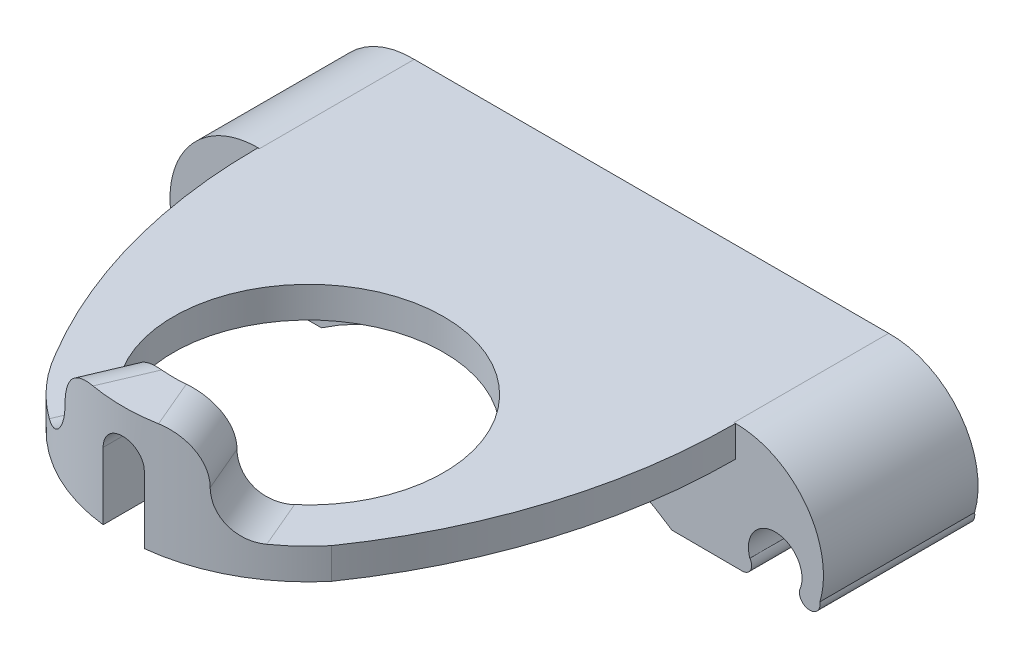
ISO-10303-21;
HEADER;
FILE_DESCRIPTION(('STEP AP214'),'2;1');
FILE_NAME('part.step','',(''),(''),'','','');
FILE_SCHEMA(('AUTOMOTIVE_DESIGN { 1 0 10303 214 1 1 1 1 }'));
ENDSEC;
DATA;
#1=APPLICATION_CONTEXT('core data for automotive mechanical design processes');
#2=APPLICATION_PROTOCOL_DEFINITION('international standard','automotive_design',2000,#1);
#3=PRODUCT_CONTEXT('',#1,'mechanical');
#4=PRODUCT('Part','Part','',(#3));
#5=PRODUCT_RELATED_PRODUCT_CATEGORY('part','',(#4));
#6=PRODUCT_DEFINITION_FORMATION('','',#4);
#7=PRODUCT_DEFINITION_CONTEXT('part definition',#1,'design');
#8=PRODUCT_DEFINITION('design','',#6,#7);
#9=PRODUCT_DEFINITION_SHAPE('','',#8);
#10=(LENGTH_UNIT() NAMED_UNIT(*) SI_UNIT(.MILLI.,.METRE.));
#11=(NAMED_UNIT(*) PLANE_ANGLE_UNIT() SI_UNIT($,.RADIAN.));
#12=(NAMED_UNIT(*) SI_UNIT($,.STERADIAN.) SOLID_ANGLE_UNIT());
#13=UNCERTAINTY_MEASURE_WITH_UNIT(LENGTH_MEASURE(1.E-05),#10,'distance_accuracy_value','');
#14=(GEOMETRIC_REPRESENTATION_CONTEXT(3) GLOBAL_UNCERTAINTY_ASSIGNED_CONTEXT((#13)) GLOBAL_UNIT_ASSIGNED_CONTEXT((#10,
#11,#12)) REPRESENTATION_CONTEXT('',''));
#15=CARTESIAN_POINT('',(0.,0.,0.));
#16=DIRECTION('',(0.,0.,1.));
#17=DIRECTION('',(1.,0.,0.));
#18=AXIS2_PLACEMENT_3D('',#15,#16,#17);
#19=CARTESIAN_POINT('',(-2.1533602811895,9.03685712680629,15.));
#20=DIRECTION('',(0.,1.,0.));
#21=DIRECTION('',(-1.,0.,0.));
#22=AXIS2_PLACEMENT_3D('',#19,#20,#21);
#23=PLANE('',#22);
#24=DIRECTION('',(0.,0.,-1.));
#25=VECTOR('',#24,1.);
#26=CARTESIAN_POINT('',(-33.7671071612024,9.03685712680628,15.));
#27=LINE('',#26,#25);
#28=CARTESIAN_POINT('',(-33.7671071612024,9.03685712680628,51.1567570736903));
#29=VERTEX_POINT('',#28);
#30=CARTESIAN_POINT('',(-33.7671071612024,9.03685712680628,46.2129085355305));
#31=VERTEX_POINT('',#30);
#32=EDGE_CURVE('E219',#29,#31,#27,.T.);
#33=ORIENTED_EDGE('',*,*,#32,.F.);
#34=CARTESIAN_POINT('',(-31.7381994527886,9.03685712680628,33.2709792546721));
#35=DIRECTION('',(0.,-1.,0.));
#36=DIRECTION('',(1.,0.,0.));
#37=AXIS2_PLACEMENT_3D('',#34,#35,#36);
#38=CIRCLE('',#37,18.0004865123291);
#39=CARTESIAN_POINT('',(-47.4533224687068,9.03685712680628,42.0489302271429));
#40=VERTEX_POINT('',#39);
#41=EDGE_CURVE('E465',#29,#40,#38,.T.);
#42=ORIENTED_EDGE('',*,*,#41,.T.);
#43=CARTESIAN_POINT('',(-2.1533602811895,9.03685712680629,15.));
#44=DIRECTION('',(0.,-1.,0.));
#45=DIRECTION('',(-1.,0.,0.));
#46=AXIS2_PLACEMENT_3D('',#43,#44,#45);
#47=CIRCLE('',#46,52.7610765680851);
#48=CARTESIAN_POINT('',(-54.9144368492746,9.03685712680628,15.));
#49=VERTEX_POINT('',#48);
#50=EDGE_CURVE('E455',#40,#49,#47,.T.);
#51=ORIENTED_EDGE('',*,*,#50,.T.);
#52=DIRECTION('',(1.,0.,0.));
#53=VECTOR('',#52,1.);
#54=CARTESIAN_POINT('',(-54.9144368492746,9.03685712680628,15.));
#55=LINE('',#54,#53);
#56=CARTESIAN_POINT('',(-8.61977747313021,9.03685712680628,15.));
#57=VERTEX_POINT('',#56);
#58=EDGE_CURVE('E468',#49,#57,#55,.T.);
#59=ORIENTED_EDGE('',*,*,#58,.T.);
#60=CARTESIAN_POINT('',(-61.0050093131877,9.03685712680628,15.));
#61=DIRECTION('',(0.,-1.,0.));
#62=DIRECTION('',(1.,0.,0.));
#63=AXIS2_PLACEMENT_3D('',#60,#61,#62);
#64=CIRCLE('',#63,52.3852318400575);
#65=CARTESIAN_POINT('',(-17.9569114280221,9.03685712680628,44.8508590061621));
#66=VERTEX_POINT('',#65);
#67=EDGE_CURVE('E466',#57,#66,#64,.T.);
#68=ORIENTED_EDGE('',*,*,#67,.T.);
#69=CARTESIAN_POINT('',(-29.7671071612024,9.03685712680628,51.1632208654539));
#70=VERTEX_POINT('',#69);
#71=EDGE_CURVE('E451',#66,#70,#38,.T.);
#72=ORIENTED_EDGE('',*,*,#71,.T.);
#73=DIRECTION('',(0.,0.,1.));
#74=VECTOR('',#73,1.);
#75=CARTESIAN_POINT('',(-29.7671071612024,9.03685712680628,15.));
#76=LINE('',#75,#74);
#77=CARTESIAN_POINT('',(-29.7671071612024,9.03685712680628,46.221840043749));
#78=VERTEX_POINT('',#77);
#79=EDGE_CURVE('E215',#78,#70,#76,.T.);
#80=ORIENTED_EDGE('',*,*,#79,.F.);
#81=CARTESIAN_POINT('',(-31.7381994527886,9.03685712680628,33.2709792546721));
#82=DIRECTION('',(0.,-1.,0.));
#83=DIRECTION('',(1.,0.,0.));
#84=AXIS2_PLACEMENT_3D('',#81,#82,#83);
#85=CIRCLE('',#84,13.1);
#86=EDGE_CURVE('E463',#31,#78,#85,.T.);
#87=ORIENTED_EDGE('',*,*,#86,.F.);
#88=EDGE_LOOP('',(#33,#42,#51,#59,#68,#72,#80,#87));
#89=FACE_BOUND('',#88,.T.);
#90=ADVANCED_FACE('F39',(#89),#23,.F.);
#91=CARTESIAN_POINT('',(-31.7381994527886,9.03685712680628,33.2709792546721));
#92=DIRECTION('',(0.,1.,0.));
#93=DIRECTION('',(-1.,0.,0.));
#94=AXIS2_PLACEMENT_3D('',#91,#92,#93);
#95=CYLINDRICAL_SURFACE('',#94,18.0004865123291);
#96=CARTESIAN_POINT('',(-29.7671071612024,15.5368571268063,51.1632208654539));
#97=CARTESIAN_POINT('',(-29.7671073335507,15.592946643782,51.1632193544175));
#98=CARTESIAN_POINT('',(-29.7694681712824,15.649009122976,51.1634811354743));
#99=CARTESIAN_POINT('',(-29.778885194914,15.7607295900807,51.1645153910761));
#100=CARTESIAN_POINT('',(-29.7859410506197,15.8163876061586,51.1652878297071));
#101=CARTESIAN_POINT('',(-29.814078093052,15.9820376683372,51.1683436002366));
#102=CARTESIAN_POINT('',(-29.8421289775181,16.0909148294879,51.1713655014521));
#103=CARTESIAN_POINT('',(-29.9160133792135,16.302375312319,51.1790365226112));
#104=CARTESIAN_POINT('',(-29.9618532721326,16.4049563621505,51.1836862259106));
#105=CARTESIAN_POINT('',(-30.0699993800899,16.6009749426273,51.194080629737));
#106=CARTESIAN_POINT('',(-30.1323038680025,16.6944134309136,51.1998252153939));
#107=CARTESIAN_POINT('',(-30.2718915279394,16.869879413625,51.2117809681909));
#108=CARTESIAN_POINT('',(-30.3492303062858,16.9518625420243,51.217993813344));
#109=CARTESIAN_POINT('',(-30.516582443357,17.1017230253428,51.230160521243));
#110=CARTESIAN_POINT('',(-30.606597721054,17.1695982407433,51.2361143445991));
#111=CARTESIAN_POINT('',(-30.7970123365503,17.2894558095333,51.2470963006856));
#112=CARTESIAN_POINT('',(-30.8974363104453,17.3413992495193,51.2521221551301));
#113=CARTESIAN_POINT('',(-31.1056404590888,17.4276658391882,51.2606492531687));
#114=CARTESIAN_POINT('',(-31.2134199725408,17.4619905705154,51.2641506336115));
#115=CARTESIAN_POINT('',(-31.4328056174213,17.5119129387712,51.2692078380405));
#116=CARTESIAN_POINT('',(-31.5443939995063,17.5275877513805,51.2707716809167));
#117=CARTESIAN_POINT('',(-31.7686296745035,17.5400061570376,51.2717891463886));
#118=CARTESIAN_POINT('',(-31.8812769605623,17.5367498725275,51.2712427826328));
#119=CARTESIAN_POINT('',(-32.103920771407,17.5114598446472,51.268093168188));
#120=CARTESIAN_POINT('',(-32.2139265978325,17.489506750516,51.2654987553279));
#121=CARTESIAN_POINT('',(-32.4286804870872,17.4275739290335,51.2585388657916));
#122=CARTESIAN_POINT('',(-32.5334284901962,17.3875939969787,51.254173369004));
#123=CARTESIAN_POINT('',(-32.7349736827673,17.2906441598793,51.2441306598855));
#124=CARTESIAN_POINT('',(-32.8317517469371,17.2336348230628,51.2384504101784));
#125=CARTESIAN_POINT('',(-33.0143930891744,17.1042757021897,51.2264027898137));
#126=CARTESIAN_POINT('',(-33.1002564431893,17.0319260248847,51.2200354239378));
#127=CARTESIAN_POINT('',(-33.2591158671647,16.8734807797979,51.2072755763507));
#128=CARTESIAN_POINT('',(-33.3320410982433,16.7873141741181,51.2008831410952));
#129=CARTESIAN_POINT('',(-33.4624249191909,16.6038898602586,51.1888157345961));
#130=CARTESIAN_POINT('',(-33.5198788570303,16.5066288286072,51.1831409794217));
#131=CARTESIAN_POINT('',(-33.617682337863,16.303717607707,51.1731435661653));
#132=CARTESIAN_POINT('',(-33.6580187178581,16.1980610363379,51.1688219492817));
#133=CARTESIAN_POINT('',(-33.7202974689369,15.9814926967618,51.1620328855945));
#134=CARTESIAN_POINT('',(-33.7422676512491,15.8705891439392,51.1595626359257));
#135=CARTESIAN_POINT('',(-33.7588767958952,15.7218931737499,51.1576889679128));
#136=CARTESIAN_POINT('',(-33.7619646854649,15.6849214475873,51.1573397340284));
#137=CARTESIAN_POINT('',(-33.7660770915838,15.6109240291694,51.1568740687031));
#138=CARTESIAN_POINT('',(-33.7671050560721,15.5738985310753,51.1567572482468));
#139=CARTESIAN_POINT('',(-33.7671071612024,15.5368571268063,51.1567570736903));
#140=B_SPLINE_CURVE_WITH_KNOTS('',3,(#96,#97,#98,#99,#100,#101,#102,#103,#104,#105,#106,#107,
#108,#109,#110,#111,#112,#113,#114,#115,#116,#117,#118,#119,#120,#121,#122,#123,#124,#125,#126,
#127,#128,#129,#130,#131,#132,#133,#134,#135,#136,#137,#138,#139),.UNSPECIFIED.,.F.,.F.,(4,2,2,
2,2,2,2,2,2,2,2,2,2,2,2,2,2,2,2,2,2,4),(0.,0.168164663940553,0.336317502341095,
0.672003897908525,1.00781071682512,1.3435823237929,1.68062030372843,2.01770935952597,
2.35561531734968,2.69349093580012,3.02996346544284,3.36643381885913,3.70146010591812,
4.0364901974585,4.37230214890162,4.7081117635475,5.04570678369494,5.38340320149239,
5.72135883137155,6.05880177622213,6.17006615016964,6.28114413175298),.UNSPECIFIED.);
#141=CARTESIAN_POINT('',(-29.7671071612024,15.5368571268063,51.1632208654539));
#142=VERTEX_POINT('',#141);
#143=CARTESIAN_POINT('',(-33.7671071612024,15.5368571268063,51.1567570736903));
#144=VERTEX_POINT('',#143);
#145=EDGE_CURVE('E224',#142,#144,#140,.T.);
#146=ORIENTED_EDGE('',*,*,#145,.F.);
#147=DIRECTION('',(0.,1.,0.));
#148=VECTOR('',#147,1.);
#149=CARTESIAN_POINT('',(-29.7671071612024,9.03685712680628,51.1632208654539));
#150=LINE('',#149,#148);
#151=EDGE_CURVE('E212',#70,#142,#150,.T.);
#152=ORIENTED_EDGE('',*,*,#151,.F.);
#153=ORIENTED_EDGE('',*,*,#71,.F.);
#154=DIRECTION('',(0.,1.,0.));
#155=VECTOR('',#154,1.);
#156=CARTESIAN_POINT('',(-17.9569114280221,9.03685712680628,44.8508590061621));
#157=LINE('',#156,#155);
#158=CARTESIAN_POINT('',(-17.9569114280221,12.0368571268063,44.8508590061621));
#159=VERTEX_POINT('',#158);
#160=EDGE_CURVE('E445',#66,#159,#157,.T.);
#161=ORIENTED_EDGE('',*,*,#160,.T.);
#162=CARTESIAN_POINT('',(-31.7381994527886,12.0368571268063,33.2709792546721));
#163=DIRECTION('',(0.,-1.,0.));
#164=DIRECTION('',(1.,0.,0.));
#165=AXIS2_PLACEMENT_3D('',#162,#163,#164);
#166=CIRCLE('',#165,18.0004865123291);
#167=CARTESIAN_POINT('',(-21.1976100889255,12.0368571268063,47.8625347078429));
#168=VERTEX_POINT('',#167);
#169=EDGE_CURVE('E452',#159,#168,#166,.T.);
#170=ORIENTED_EDGE('',*,*,#169,.T.);
#171=CARTESIAN_POINT('',(-21.1976100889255,12.0368571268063,47.8625347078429));
#172=CARTESIAN_POINT('',(-21.288588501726,12.0368444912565,47.9282677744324));
#173=CARTESIAN_POINT('',(-21.3801991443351,12.041347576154,47.9931380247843));
#174=CARTESIAN_POINT('',(-21.5640157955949,12.0594142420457,48.1207578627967));
#175=CARTESIAN_POINT('',(-21.65622186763,12.0729788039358,48.1835072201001));
#176=CARTESIAN_POINT('',(-21.8405043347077,12.1091904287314,48.3064518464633));
#177=CARTESIAN_POINT('',(-21.9325807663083,12.1318339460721,48.3666481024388));
#178=CARTESIAN_POINT('',(-22.1159051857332,12.1861326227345,48.4841582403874));
#179=CARTESIAN_POINT('',(-22.2071532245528,12.2177872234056,48.5414723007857));
#180=CARTESIAN_POINT('',(-22.3881762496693,12.2900020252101,48.6529783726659));
#181=CARTESIAN_POINT('',(-22.4779494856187,12.3305720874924,48.7071668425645));
#182=CARTESIAN_POINT('',(-22.6551856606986,12.4203814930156,48.8121177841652));
#183=CARTESIAN_POINT('',(-22.7426477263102,12.4696240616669,48.8628789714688));
#184=CARTESIAN_POINT('',(-22.9143937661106,12.5764109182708,48.9607124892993));
#185=CARTESIAN_POINT('',(-22.9986802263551,12.6339485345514,49.0077877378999));
#186=CARTESIAN_POINT('',(-23.1634333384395,12.7569875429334,49.0981626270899));
#187=CARTESIAN_POINT('',(-23.2438985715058,12.8224918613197,49.1414608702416));
#188=CARTESIAN_POINT('',(-23.399231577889,12.9600788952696,49.2236200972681));
#189=CARTESIAN_POINT('',(-23.4741588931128,13.0320641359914,49.2625318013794));
#190=CARTESIAN_POINT('',(-23.618932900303,13.1828508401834,49.3365211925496));
#191=CARTESIAN_POINT('',(-23.6887777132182,13.2616548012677,49.3715974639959));
#192=CARTESIAN_POINT('',(-23.8227429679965,13.4255055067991,49.4378791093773));
#193=CARTESIAN_POINT('',(-23.8868638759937,13.5105517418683,49.4690847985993));
#194=CARTESIAN_POINT('',(-24.0088371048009,13.6862937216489,49.5276408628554));
#195=CARTESIAN_POINT('',(-24.0666871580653,13.7769914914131,49.5549898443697));
#196=CARTESIAN_POINT('',(-24.2305762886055,14.0575629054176,49.6315338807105));
#197=CARTESIAN_POINT('',(-24.3263650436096,14.255195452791,49.6749393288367));
#198=CARTESIAN_POINT('',(-24.486953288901,14.6650785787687,49.7465588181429));
#199=CARTESIAN_POINT('',(-24.5517671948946,14.8773223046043,49.7747799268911));
#200=CARTESIAN_POINT('',(-24.6343590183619,15.2481751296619,49.8104589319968));
#201=CARTESIAN_POINT('',(-24.6603012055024,15.4046700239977,49.8215529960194));
#202=CARTESIAN_POINT('',(-24.6949492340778,15.7197109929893,49.8363114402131));
#203=CARTESIAN_POINT('',(-24.7036756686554,15.8782543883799,49.8399846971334));
#204=CARTESIAN_POINT('',(-24.7036323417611,16.0368571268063,49.8399979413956));
#205=B_SPLINE_CURVE_WITH_KNOTS('',3,(#171,#172,#173,#174,#175,#176,#177,#178,#179,#180,#181,
#182,#183,#184,#185,#186,#187,#188,#189,#190,#191,#192,#193,#194,#195,#196,#197,#198,#199,#200,
#201,#202,#203,#204),.UNSPECIFIED.,.F.,.F.,(4,2,2,2,2,2,2,2,2,2,2,2,2,2,2,2,4),(0.,
0.336636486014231,0.673309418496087,1.00985099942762,1.34637172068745,1.68326654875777,
2.02028693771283,2.35703775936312,2.69391265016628,3.0263721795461,3.35895400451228,
3.69150872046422,4.0241832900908,4.69241488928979,5.36033518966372,5.83631739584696,
6.31172989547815),.UNSPECIFIED.);
#206=CARTESIAN_POINT('',(-24.7036323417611,16.0368571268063,49.8399979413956));
#207=VERTEX_POINT('',#206);
#208=EDGE_CURVE('E481',#168,#207,#205,.T.);
#209=ORIENTED_EDGE('',*,*,#208,.T.);
#210=CARTESIAN_POINT('',(-24.7036323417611,16.0368571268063,49.8399979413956));
#211=CARTESIAN_POINT('',(-24.7036255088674,16.1493086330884,49.8399865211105));
#212=CARTESIAN_POINT('',(-24.7079972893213,16.2617550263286,49.8418509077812));
#213=CARTESIAN_POINT('',(-24.7254437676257,16.4858442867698,49.8492462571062));
#214=CARTESIAN_POINT('',(-24.7385180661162,16.5974871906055,49.8547770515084));
#215=CARTESIAN_POINT('',(-24.7733036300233,16.8191124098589,49.8694152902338));
#216=CARTESIAN_POINT('',(-24.7950091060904,16.9290957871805,49.8785203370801));
#217=CARTESIAN_POINT('',(-24.8469250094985,17.1466626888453,49.9001293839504));
#218=CARTESIAN_POINT('',(-24.8771353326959,17.2542462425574,49.912633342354));
#219=CARTESIAN_POINT('',(-24.9803645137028,17.5723652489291,49.9549477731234));
#220=CARTESIAN_POINT('',(-25.065994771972,17.7783531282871,49.9895665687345));
#221=CARTESIAN_POINT('',(-25.2689216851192,18.171732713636,50.0691265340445));
#222=CARTESIAN_POINT('',(-25.3862129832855,18.3591275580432,50.1140659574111));
#223=CARTESIAN_POINT('',(-25.6495969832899,18.7097713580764,50.2110511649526));
#224=CARTESIAN_POINT('',(-25.7956296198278,18.8730694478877,50.2630820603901));
#225=CARTESIAN_POINT('',(-26.1131417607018,19.1712563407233,50.3708117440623));
#226=CARTESIAN_POINT('',(-26.2846210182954,19.3061454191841,50.4265104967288));
#227=CARTESIAN_POINT('',(-26.6470243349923,19.5427190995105,50.5375083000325));
#228=CARTESIAN_POINT('',(-26.8377725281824,19.6446736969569,50.5928067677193));
#229=CARTESIAN_POINT('',(-27.2347716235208,19.8143126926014,50.7002319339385));
#230=CARTESIAN_POINT('',(-27.4410186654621,19.8820055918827,50.7523594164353));
#231=CARTESIAN_POINT('',(-27.8003086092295,19.9669603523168,50.8361078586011));
#232=CARTESIAN_POINT('',(-27.9509491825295,19.9932307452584,50.8692194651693));
#233=CARTESIAN_POINT('',(-28.2547344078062,20.0281808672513,50.9318762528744));
#234=CARTESIAN_POINT('',(-28.4078746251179,20.0368889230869,50.9614271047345));
#235=CARTESIAN_POINT('',(-28.5614193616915,20.0368571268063,50.9889244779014));
#236=B_SPLINE_CURVE_WITH_KNOTS('',3,(#210,#211,#212,#213,#214,#215,#216,#217,#218,#219,#220,
#221,#222,#223,#224,#225,#226,#227,#228,#229,#230,#231,#232,#233,#234,#235),.UNSPECIFIED.,.F.,
.F.,(4,2,2,2,2,2,2,2,2,2,2,2,4),(0.,0.337244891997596,0.674474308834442,1.01147791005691,
1.34847738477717,2.02222364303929,2.69585598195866,3.36809519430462,4.04032788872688,
4.70690088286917,5.37330840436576,5.84168608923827,6.30930770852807),.UNSPECIFIED.);
#237=CARTESIAN_POINT('',(-28.5614193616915,20.0368571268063,50.9889244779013));
#238=VERTEX_POINT('',#237);
#239=EDGE_CURVE('E327',#207,#238,#236,.T.);
#240=ORIENTED_EDGE('',*,*,#239,.T.);
#241=CARTESIAN_POINT('',(-31.7381994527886,20.0368571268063,33.2709792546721));
#242=DIRECTION('',(0.,1.,0.));
#243=DIRECTION('',(-1.,0.,0.));
#244=AXIS2_PLACEMENT_3D('',#241,#242,#243);
#245=CIRCLE('',#244,18.0004865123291);
#246=CARTESIAN_POINT('',(-34.9149795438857,20.0368571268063,50.9889244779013));
#247=VERTEX_POINT('',#246);
#248=EDGE_CURVE('E474',#247,#238,#245,.T.);
#249=ORIENTED_EDGE('',*,*,#248,.F.);
#250=CARTESIAN_POINT('',(-34.9149795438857,20.0368571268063,50.9889244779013));
#251=CARTESIAN_POINT('',(-35.0254599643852,20.0368697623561,50.9691258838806));
#252=CARTESIAN_POINT('',(-35.13575875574,20.0323666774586,50.948273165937));
#253=CARTESIAN_POINT('',(-35.3552441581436,20.0143000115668,50.904666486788));
#254=CARTESIAN_POINT('',(-35.4644306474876,20.0007354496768,50.881912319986));
#255=CARTESIAN_POINT('',(-35.6808760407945,19.9645238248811,50.8347233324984));
#256=CARTESIAN_POINT('',(-35.7881356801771,19.9418803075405,50.8102891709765));
#257=CARTESIAN_POINT('',(-36.0000058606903,19.8875816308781,50.7600149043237));
#258=CARTESIAN_POINT('',(-36.1046165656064,19.855927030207,50.7341748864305));
#259=CARTESIAN_POINT('',(-36.3105687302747,19.7837122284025,50.6813861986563));
#260=CARTESIAN_POINT('',(-36.4119064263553,19.7431421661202,50.6544363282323));
#261=CARTESIAN_POINT('',(-36.6105123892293,19.653332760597,50.599819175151));
#262=CARTESIAN_POINT('',(-36.7077791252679,19.6040901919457,50.5721516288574));
#263=CARTESIAN_POINT('',(-36.8974513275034,19.4973033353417,50.5165408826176));
#264=CARTESIAN_POINT('',(-36.9898606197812,19.4397657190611,50.4885979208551));
#265=CARTESIAN_POINT('',(-37.1693098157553,19.3167267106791,50.4328377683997));
#266=CARTESIAN_POINT('',(-37.2563477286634,19.2512223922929,50.4050206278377));
#267=CARTESIAN_POINT('',(-37.4233434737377,19.1136353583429,50.3503314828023));
#268=CARTESIAN_POINT('',(-37.5033791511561,19.0416501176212,50.3234518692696));
#269=CARTESIAN_POINT('',(-37.6571633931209,18.8908634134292,50.2706849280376));
#270=CARTESIAN_POINT('',(-37.7309096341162,18.8120594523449,50.2447979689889));
#271=CARTESIAN_POINT('',(-37.8716413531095,18.6482087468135,50.1944538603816));
#272=CARTESIAN_POINT('',(-37.9386273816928,18.5631625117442,50.1699965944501));
#273=CARTESIAN_POINT('',(-38.0654719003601,18.3874205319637,50.1229142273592));
#274=CARTESIAN_POINT('',(-38.1253278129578,18.2967227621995,50.1002897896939));
#275=CARTESIAN_POINT('',(-38.294226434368,18.016151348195,50.0355449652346));
#276=CARTESIAN_POINT('',(-38.3919844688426,17.8185188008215,49.9967779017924));
#277=CARTESIAN_POINT('',(-38.5550475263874,17.4086356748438,49.9309875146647));
#278=CARTESIAN_POINT('',(-38.6203676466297,17.1963919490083,49.9039587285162));
#279=CARTESIAN_POINT('',(-38.7034009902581,16.8255391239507,49.8693196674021));
#280=CARTESIAN_POINT('',(-38.7294007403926,16.6690442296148,49.8583611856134));
#281=CARTESIAN_POINT('',(-38.7640834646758,16.3540032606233,49.8436844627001));
#282=CARTESIAN_POINT('',(-38.7727871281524,16.1954598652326,49.839957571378));
#283=CARTESIAN_POINT('',(-38.7727665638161,16.0368571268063,49.8399979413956));
#284=B_SPLINE_CURVE_WITH_KNOTS('',3,(#250,#251,#252,#253,#254,#255,#256,#257,#258,#259,#260,
#261,#262,#263,#264,#265,#266,#267,#268,#269,#270,#271,#272,#273,#274,#275,#276,#277,#278,#279,
#280,#281,#282,#283),.UNSPECIFIED.,.F.,.F.,(4,2,2,2,2,2,2,2,2,2,2,2,2,2,2,2,4),(0.,
0.336636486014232,0.673309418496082,1.0098509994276,1.34637172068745,1.68326654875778,
2.02028693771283,2.35703775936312,2.69391265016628,3.02637217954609,3.35895400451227,
3.69150872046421,4.0241832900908,4.69241488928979,5.36033518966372,5.83631739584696,
6.31172989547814),.UNSPECIFIED.);
#285=CARTESIAN_POINT('',(-38.7727665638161,16.0368571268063,49.8399979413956));
#286=VERTEX_POINT('',#285);
#287=EDGE_CURVE('E63',#247,#286,#284,.T.);
#288=ORIENTED_EDGE('',*,*,#287,.T.);
#289=CARTESIAN_POINT('',(-38.7727665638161,16.0368571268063,49.8399979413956));
#290=CARTESIAN_POINT('',(-38.7727536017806,15.9244056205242,49.839994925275));
#291=CARTESIAN_POINT('',(-38.7771313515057,15.811959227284,49.8381445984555));
#292=CARTESIAN_POINT('',(-38.7945693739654,15.5878699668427,49.830729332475));
#293=CARTESIAN_POINT('',(-38.8076292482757,15.4762270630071,49.8251645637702));
#294=CARTESIAN_POINT('',(-38.8423210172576,15.2546018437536,49.8103054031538));
#295=CARTESIAN_POINT('',(-38.8639471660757,15.144618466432,49.8010135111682));
#296=CARTESIAN_POINT('',(-38.915551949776,14.9270515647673,49.778671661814));
#297=CARTESIAN_POINT('',(-38.9455304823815,14.8194680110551,49.765621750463));
#298=CARTESIAN_POINT('',(-39.0476713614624,14.5013490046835,49.7207439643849));
#299=CARTESIAN_POINT('',(-39.1320522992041,14.2953611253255,49.6831825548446));
#300=CARTESIAN_POINT('',(-39.330234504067,13.9019815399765,49.5924470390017));
#301=CARTESIAN_POINT('',(-39.444030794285,13.7145866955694,49.5392755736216));
#302=CARTESIAN_POINT('',(-39.6967400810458,13.3639428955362,49.4171474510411));
#303=CARTESIAN_POINT('',(-39.8356006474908,13.2006448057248,49.3482236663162));
#304=CARTESIAN_POINT('',(-40.1336348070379,12.9024579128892,49.1946161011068));
#305=CARTESIAN_POINT('',(-40.292808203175,12.7675688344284,49.1099324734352));
#306=CARTESIAN_POINT('',(-40.6243728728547,12.5309951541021,48.9262982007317));
#307=CARTESIAN_POINT('',(-40.7966415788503,12.4290405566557,48.8274736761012));
#308=CARTESIAN_POINT('',(-41.1496645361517,12.2594015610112,48.616468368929));
#309=CARTESIAN_POINT('',(-41.3304166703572,12.1917086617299,48.5042909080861));
#310=CARTESIAN_POINT('',(-41.640214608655,12.1067539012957,48.3039704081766));
#311=CARTESIAN_POINT('',(-41.7686643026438,12.0804835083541,48.2185910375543));
#312=CARTESIAN_POINT('',(-42.0247370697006,12.0455333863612,48.0435536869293));
#313=CARTESIAN_POINT('',(-42.1523611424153,12.0368253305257,47.9539028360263));
#314=CARTESIAN_POINT('',(-42.2787888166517,12.0368571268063,47.8625347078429));
#315=B_SPLINE_CURVE_WITH_KNOTS('',3,(#289,#290,#291,#292,#293,#294,#295,#296,#297,#298,#299,
#300,#301,#302,#303,#304,#305,#306,#307,#308,#309,#310,#311,#312,#313,#314),.UNSPECIFIED.,.F.,
.F.,(4,2,2,2,2,2,2,2,2,2,2,2,4),(0.,0.337244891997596,0.674474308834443,1.01147791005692,
1.34847738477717,2.0222236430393,2.69585598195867,3.36809519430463,4.04032788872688,
4.70690088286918,5.37330840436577,5.84168608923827,6.30930770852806),.UNSPECIFIED.);
#316=CARTESIAN_POINT('',(-42.2787888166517,12.0368571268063,47.8625347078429));
#317=VERTEX_POINT('',#316);
#318=EDGE_CURVE('E310',#286,#317,#315,.T.);
#319=ORIENTED_EDGE('',*,*,#318,.T.);
#320=CARTESIAN_POINT('',(-47.4533224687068,12.0368571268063,42.0489302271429));
#321=VERTEX_POINT('',#320);
#322=EDGE_CURVE('E456',#317,#321,#166,.T.);
#323=ORIENTED_EDGE('',*,*,#322,.T.);
#324=DIRECTION('',(0.,1.,0.));
#325=VECTOR('',#324,1.);
#326=CARTESIAN_POINT('',(-47.4533224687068,9.03685712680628,42.0489302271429));
#327=LINE('',#326,#325);
#328=EDGE_CURVE('E448',#40,#321,#327,.T.);
#329=ORIENTED_EDGE('',*,*,#328,.F.);
#330=ORIENTED_EDGE('',*,*,#41,.F.);
#331=DIRECTION('',(0.,1.,0.));
#332=VECTOR('',#331,1.);
#333=CARTESIAN_POINT('',(-33.7671071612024,9.03685712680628,51.1567570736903));
#334=LINE('',#333,#332);
#335=EDGE_CURVE('E233',#144,#29,#334,.F.);
#336=ORIENTED_EDGE('',*,*,#335,.F.);
#337=EDGE_LOOP('',(#146,#152,#153,#161,#170,#209,#240,#249,#288,#319,#323,#329,#330,#336));
#338=FACE_BOUND('',#337,.T.);
#339=ADVANCED_FACE('F231',(#338),#95,.T.);
#340=CARTESIAN_POINT('',(-31.7381994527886,9.03685712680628,33.2709792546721));
#341=DIRECTION('',(0.,1.,0.));
#342=DIRECTION('',(-1.,0.,0.));
#343=AXIS2_PLACEMENT_3D('',#340,#341,#342);
#344=CYLINDRICAL_SURFACE('',#343,13.1);
#345=CARTESIAN_POINT('',(-31.7381994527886,20.0368571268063,33.2709792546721));
#346=DIRECTION('',(0.,-1.,0.));
#347=DIRECTION('',(-1.,0.,0.));
#348=AXIS2_PLACEMENT_3D('',#345,#346,#347);
#349=CIRCLE('',#348,13.1);
#350=CARTESIAN_POINT('',(-30.5451347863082,20.0368571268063,46.3165377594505));
#351=VERTEX_POINT('',#350);
#352=CARTESIAN_POINT('',(-32.931264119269,20.0368571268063,46.3165377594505));
#353=VERTEX_POINT('',#352);
#354=EDGE_CURVE('E248',#351,#353,#349,.T.);
#355=ORIENTED_EDGE('',*,*,#354,.F.);
#356=CARTESIAN_POINT('',(-30.5451347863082,20.0368571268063,46.3165377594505));
#357=CARTESIAN_POINT('',(-30.4335861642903,20.0368699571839,46.3063494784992));
#358=CARTESIAN_POINT('',(-30.322156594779,20.0325911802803,46.2947033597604));
#359=CARTESIAN_POINT('',(-30.1002740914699,20.0153232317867,46.2686555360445));
#360=CARTESIAN_POINT('',(-29.9898213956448,20.0023319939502,46.2542531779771));
#361=CARTESIAN_POINT('',(-29.7706896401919,19.9675125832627,46.222858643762));
#362=CARTESIAN_POINT('',(-29.6620105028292,19.9456847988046,46.2058665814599));
#363=CARTESIAN_POINT('',(-29.4472194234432,19.893175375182,46.1695554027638));
#364=CARTESIAN_POINT('',(-29.3411072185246,19.8624946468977,46.150236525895));
#365=CARTESIAN_POINT('',(-29.132030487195,19.7922863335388,46.1095635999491));
#366=CARTESIAN_POINT('',(-29.029071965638,19.7527429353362,46.0882059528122));
#367=CARTESIAN_POINT('',(-28.8272251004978,19.6649977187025,46.043876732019));
#368=CARTESIAN_POINT('',(-28.7283382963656,19.6167926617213,46.0209045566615));
#369=CARTESIAN_POINT('',(-28.5354936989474,19.5120608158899,45.9738340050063));
#370=CARTESIAN_POINT('',(-28.4415309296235,19.4555426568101,45.9497368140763));
#371=CARTESIAN_POINT('',(-28.2590496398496,19.3344889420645,45.9008819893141));
#372=CARTESIAN_POINT('',(-28.1705331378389,19.2699504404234,45.8761241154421));
#373=CARTESIAN_POINT('',(-28.0016284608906,19.1349599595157,45.8270768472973));
#374=CARTESIAN_POINT('',(-27.9210962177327,19.06468701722,45.8027904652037));
#375=CARTESIAN_POINT('',(-27.7662772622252,18.917400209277,45.7545849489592));
#376=CARTESIAN_POINT('',(-27.6919928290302,18.8403839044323,45.730665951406));
#377=CARTESIAN_POINT('',(-27.5501225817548,18.6801581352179,45.6836984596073));
#378=CARTESIAN_POINT('',(-27.4825367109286,18.5969487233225,45.6606499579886));
#379=CARTESIAN_POINT('',(-27.3544139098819,18.4249158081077,45.6158983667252));
#380=CARTESIAN_POINT('',(-27.2938795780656,18.3360902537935,45.5941957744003));
#381=CARTESIAN_POINT('',(-27.1223455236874,18.0604734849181,45.531437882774));
#382=CARTESIAN_POINT('',(-27.0225848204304,17.8658682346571,45.493131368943));
#383=CARTESIAN_POINT('',(-26.8551220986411,17.4618152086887,45.4272010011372));
#384=CARTESIAN_POINT('',(-26.7874085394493,17.2523728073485,45.3995733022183));
#385=CARTESIAN_POINT('',(-26.6971836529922,16.87492098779,45.3622943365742));
#386=CARTESIAN_POINT('',(-26.6677745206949,16.7088047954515,45.3499388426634));
#387=CARTESIAN_POINT('',(-26.6383589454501,16.4577656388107,45.3375334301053));
#388=CARTESIAN_POINT('',(-26.6310034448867,16.3737984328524,45.3344196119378));
#389=CARTESIAN_POINT('',(-26.6211918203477,16.2055127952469,45.3302597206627));
#390=CARTESIAN_POINT('',(-26.6187365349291,16.1211943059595,45.3292140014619));
#391=CARTESIAN_POINT('',(-26.618736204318,16.0368571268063,45.3292169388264));
#392=B_SPLINE_CURVE_WITH_KNOTS('',3,(#356,#357,#358,#359,#360,#361,#362,#363,#364,#365,#366,
#367,#368,#369,#370,#371,#372,#373,#374,#375,#376,#377,#378,#379,#380,#381,#382,#383,#384,#385,
#386,#387,#388,#389,#390,#391),.UNSPECIFIED.,.F.,.F.,(4,2,2,2,2,2,2,2,2,2,2,2,2,2,2,2,2,4),(0.,
0.335968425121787,0.672016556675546,1.00804991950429,1.34404872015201,1.68065186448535,
2.01738112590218,2.35376326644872,2.69026933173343,3.01870151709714,3.34725299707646,
3.67580169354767,4.00447107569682,4.66718146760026,5.32965302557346,5.83570857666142,
6.08859743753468,6.34152957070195),.UNSPECIFIED.);
#393=CARTESIAN_POINT('',(-26.618736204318,16.0368571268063,45.3292169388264));
#394=VERTEX_POINT('',#393);
#395=EDGE_CURVE('E286',#351,#394,#392,.T.);
#396=ORIENTED_EDGE('',*,*,#395,.T.);
#397=CARTESIAN_POINT('',(-26.618736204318,16.0368571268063,45.3292169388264));
#398=CARTESIAN_POINT('',(-26.6187502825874,15.9244545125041,45.3292112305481));
#399=CARTESIAN_POINT('',(-26.6143752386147,15.812057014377,45.3273651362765));
#400=CARTESIAN_POINT('',(-26.5969539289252,15.5880642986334,45.3199525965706));
#401=CARTESIAN_POINT('',(-26.5839080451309,15.4764690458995,45.3143863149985));
#402=CARTESIAN_POINT('',(-26.5492623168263,15.2549284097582,45.2994982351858));
#403=CARTESIAN_POINT('',(-26.5276675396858,15.1449820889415,45.2901786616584));
#404=CARTESIAN_POINT('',(-26.4761597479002,14.9274869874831,45.2677171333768));
#405=CARTESIAN_POINT('',(-26.4462468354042,14.8199381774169,45.254575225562));
#406=CARTESIAN_POINT('',(-26.3443828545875,14.5019141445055,45.2092521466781));
#407=CARTESIAN_POINT('',(-26.2602940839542,14.295982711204,45.171168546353));
#408=CARTESIAN_POINT('',(-26.0631461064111,13.9027194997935,45.0784155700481));
#409=CARTESIAN_POINT('',(-25.9500916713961,13.7153846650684,45.0237489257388));
#410=CARTESIAN_POINT('',(-25.6998780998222,13.3652342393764,44.8971653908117));
#411=CARTESIAN_POINT('',(-25.5628142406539,13.2023262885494,44.8253162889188));
#412=CARTESIAN_POINT('',(-25.2696893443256,12.9049479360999,44.6637969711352));
#413=CARTESIAN_POINT('',(-25.1136318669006,12.7704722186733,44.5741300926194));
#414=CARTESIAN_POINT('',(-24.791275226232,12.5355607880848,44.3788663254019));
#415=CARTESIAN_POINT('',(-24.6251777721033,12.4346189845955,44.2735446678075));
#416=CARTESIAN_POINT('',(-24.2867691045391,12.2661999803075,44.047227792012));
#417=CARTESIAN_POINT('',(-24.1144576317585,12.1987241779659,43.9262319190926));
#418=CARTESIAN_POINT('',(-23.8138096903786,12.1109538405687,43.7036030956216));
#419=CARTESIAN_POINT('',(-23.6854719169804,12.0830134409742,43.6049078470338));
#420=CARTESIAN_POINT('',(-23.4947316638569,12.0552296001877,43.4524263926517));
#421=CARTESIAN_POINT('',(-23.4314883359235,12.0483226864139,43.400895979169));
#422=CARTESIAN_POINT('',(-23.3057731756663,12.039135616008,43.2964905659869));
#423=CARTESIAN_POINT('',(-23.2433013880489,12.0368557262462,43.2436154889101));
#424=CARTESIAN_POINT('',(-23.1813255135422,12.0368571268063,43.1901479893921));
#425=B_SPLINE_CURVE_WITH_KNOTS('',3,(#397,#398,#399,#400,#401,#402,#403,#404,#405,#406,#407,
#408,#409,#410,#411,#412,#413,#414,#415,#416,#417,#418,#419,#420,#421,#422,#423,#424),
.UNSPECIFIED.,.F.,.F.,(4,2,2,2,2,2,2,2,2,2,2,2,2,4),(0.,0.337098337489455,0.674181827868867,
1.01106580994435,1.3479456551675,2.02146910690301,2.69488167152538,3.36568006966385,
4.03635294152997,4.69638799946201,5.35645063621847,5.84808059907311,6.09356235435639,
6.33905826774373),.UNSPECIFIED.);
#426=CARTESIAN_POINT('',(-23.1813255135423,12.0368571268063,43.1901479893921));
#427=VERTEX_POINT('',#426);
#428=EDGE_CURVE('E294',#394,#427,#425,.T.);
#429=ORIENTED_EDGE('',*,*,#428,.T.);
#430=CARTESIAN_POINT('',(-31.7381994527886,12.0368571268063,33.2709792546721));
#431=DIRECTION('',(0.,-1.,0.));
#432=DIRECTION('',(1.,0.,0.));
#433=AXIS2_PLACEMENT_3D('',#430,#431,#432);
#434=CIRCLE('',#433,13.1);
#435=CARTESIAN_POINT('',(-40.295073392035,12.0368571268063,43.1901479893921));
#436=VERTEX_POINT('',#435);
#437=EDGE_CURVE('E471',#436,#427,#434,.T.);
#438=ORIENTED_EDGE('',*,*,#437,.F.);
#439=CARTESIAN_POINT('',(-40.295073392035,12.0368571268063,43.1901479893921));
#440=CARTESIAN_POINT('',(-40.2102671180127,12.0368442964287,43.2633244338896));
#441=CARTESIAN_POINT('',(-40.1244947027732,12.0411230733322,43.3354026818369));
#442=CARTESIAN_POINT('',(-39.9516457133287,12.0583910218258,43.4769426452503));
#443=CARTESIAN_POINT('',(-39.8645688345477,12.0713822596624,43.5464037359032));
#444=CARTESIAN_POINT('',(-39.6897837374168,12.1062016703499,43.6822511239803));
#445=CARTESIAN_POINT('',(-39.6020755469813,12.128029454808,43.7486375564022));
#446=CARTESIAN_POINT('',(-39.426768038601,12.1805388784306,43.877947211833));
#447=CARTESIAN_POINT('',(-39.3391687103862,12.2112196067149,43.9408707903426));
#448=CARTESIAN_POINT('',(-39.1646920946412,12.2814279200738,44.0630398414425));
#449=CARTESIAN_POINT('',(-39.0778163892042,12.3209713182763,44.1222784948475));
#450=CARTESIAN_POINT('',(-38.9057308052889,12.4087165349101,44.2367065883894));
#451=CARTESIAN_POINT('',(-38.8205215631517,12.4569215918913,44.2918945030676));
#452=CARTESIAN_POINT('',(-38.652716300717,12.5616534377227,44.3979419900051));
#453=CARTESIAN_POINT('',(-38.5701176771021,12.6181715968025,44.4488059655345));
#454=CARTESIAN_POINT('',(-38.408226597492,12.7392253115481,44.5461583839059));
#455=CARTESIAN_POINT('',(-38.3289353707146,12.8037638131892,44.592645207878));
#456=CARTESIAN_POINT('',(-38.1763355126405,12.9387542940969,44.6800963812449));
#457=CARTESIAN_POINT('',(-38.1029289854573,13.0090272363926,44.7211664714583));
#458=CARTESIAN_POINT('',(-37.9607179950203,13.1563140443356,44.7990684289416));
#459=CARTESIAN_POINT('',(-37.8919152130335,13.2333303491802,44.8358987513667));
#460=CARTESIAN_POINT('',(-37.759588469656,13.3935561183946,44.9053447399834));
#461=CARTESIAN_POINT('',(-37.6960644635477,13.47676553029,44.9379604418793));
#462=CARTESIAN_POINT('',(-37.5748802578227,13.6487984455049,44.9990550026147));
#463=CARTESIAN_POINT('',(-37.5172222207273,13.737623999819,45.0275323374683));
#464=CARTESIAN_POINT('',(-37.3529321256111,14.0132407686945,45.1073524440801));
#465=CARTESIAN_POINT('',(-37.2560837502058,14.2078460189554,45.1525185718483));
#466=CARTESIAN_POINT('',(-37.0923389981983,14.6118990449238,45.2272061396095));
#467=CARTESIAN_POINT('',(-37.025431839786,14.8213414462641,45.256733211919));
#468=CARTESIAN_POINT('',(-36.9359458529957,15.1987932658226,45.2957525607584));
#469=CARTESIAN_POINT('',(-36.9066306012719,15.364909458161,45.3083291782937));
#470=CARTESIAN_POINT('',(-36.8772749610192,15.6159486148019,45.3208757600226));
#471=CARTESIAN_POINT('',(-36.8699259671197,15.6999158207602,45.3240049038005));
#472=CARTESIAN_POINT('',(-36.860118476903,15.8682014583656,45.3281745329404));
#473=CARTESIAN_POINT('',(-36.8576608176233,15.9525199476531,45.3292146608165));
#474=CARTESIAN_POINT('',(-36.8576627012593,16.0368571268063,45.3292169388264));
#475=B_SPLINE_CURVE_WITH_KNOTS('',3,(#439,#440,#441,#442,#443,#444,#445,#446,#447,#448,#449,
#450,#451,#452,#453,#454,#455,#456,#457,#458,#459,#460,#461,#462,#463,#464,#465,#466,#467,#468,
#469,#470,#471,#472,#473,#474),.UNSPECIFIED.,.F.,.F.,(4,2,2,2,2,2,2,2,2,2,2,2,2,2,2,2,2,4),(0.,
0.335968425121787,0.672016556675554,1.00804991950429,1.34404872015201,1.68065186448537,
2.0173811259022,2.35376326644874,2.69026933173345,3.01870151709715,3.34725299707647,
3.67580169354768,4.00447107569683,4.66718146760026,5.32965302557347,5.83570857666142,
6.08859743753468,6.34152957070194),.UNSPECIFIED.);
#476=CARTESIAN_POINT('',(-36.8576627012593,16.0368571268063,45.3292169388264));
#477=VERTEX_POINT('',#476);
#478=EDGE_CURVE('E303',#436,#477,#475,.T.);
#479=ORIENTED_EDGE('',*,*,#478,.T.);
#480=CARTESIAN_POINT('',(-36.8576627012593,16.0368571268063,45.3292169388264));
#481=CARTESIAN_POINT('',(-36.8576683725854,16.1492597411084,45.3292028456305));
#482=CARTESIAN_POINT('',(-36.8533015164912,16.2616572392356,45.3310682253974));
#483=CARTESIAN_POINT('',(-36.8358686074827,16.4856499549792,45.3384534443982));
#484=CARTESIAN_POINT('',(-36.822802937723,16.597245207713,45.3439731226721));
#485=CARTESIAN_POINT('',(-36.7880285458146,16.8187858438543,45.3585581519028));
#486=CARTESIAN_POINT('',(-36.7663249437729,16.9287321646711,45.3676214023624));
#487=CARTESIAN_POINT('',(-36.7143903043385,17.1462272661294,45.3890775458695));
#488=CARTESIAN_POINT('',(-36.684159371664,17.2537760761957,45.4014703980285));
#489=CARTESIAN_POINT('',(-36.5808021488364,17.5718001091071,45.4432763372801));
#490=CARTESIAN_POINT('',(-36.4949991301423,17.7777315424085,45.4773222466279));
#491=CARTESIAN_POINT('',(-36.2913390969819,18.1709947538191,45.554736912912));
#492=CARTESIAN_POINT('',(-36.1734873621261,18.3583295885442,45.5981041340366));
#493=CARTESIAN_POINT('',(-35.9086313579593,18.7084800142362,45.6901993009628));
#494=CARTESIAN_POINT('',(-35.761742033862,18.8713879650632,45.7389057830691));
#495=CARTESIAN_POINT('',(-35.4419475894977,19.1687663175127,45.8376084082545));
#496=CARTESIAN_POINT('',(-35.2690473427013,19.3032420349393,45.8876043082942));
#497=CARTESIAN_POINT('',(-34.9046727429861,19.5381534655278,45.9839001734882));
#498=CARTESIAN_POINT('',(-34.7135365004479,19.6390952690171,46.0302461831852));
#499=CARTESIAN_POINT('',(-34.3156720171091,19.8075142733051,46.1165225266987));
#500=CARTESIAN_POINT('',(-34.1089431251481,19.8749900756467,46.1564525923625));
#501=CARTESIAN_POINT('',(-33.739958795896,19.9627604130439,46.218123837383));
#502=CARTESIAN_POINT('',(-33.5798159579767,19.9907008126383,46.2419063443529));
#503=CARTESIAN_POINT('',(-33.3376352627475,20.0184846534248,46.2732264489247));
#504=CARTESIAN_POINT('',(-33.2566363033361,20.0253915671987,46.2829357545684));
#505=CARTESIAN_POINT('',(-33.094206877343,20.0345786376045,46.3008654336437));
#506=CARTESIAN_POINT('',(-33.0127763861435,20.0368585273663,46.3090857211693));
#507=CARTESIAN_POINT('',(-32.931264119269,20.0368571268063,46.3165377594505));
#508=B_SPLINE_CURVE_WITH_KNOTS('',3,(#480,#481,#482,#483,#484,#485,#486,#487,#488,#489,#490,
#491,#492,#493,#494,#495,#496,#497,#498,#499,#500,#501,#502,#503,#504,#505,#506,#507),
.UNSPECIFIED.,.F.,.F.,(4,2,2,2,2,2,2,2,2,2,2,2,2,4),(0.,0.337098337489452,0.674181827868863,
1.01106580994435,1.34794565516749,2.021469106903,2.69488167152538,3.36568006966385,
4.03635294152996,4.69638799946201,5.35645063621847,5.8480805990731,6.09356235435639,
6.33905826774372),.UNSPECIFIED.);
#509=EDGE_CURVE('E277',#477,#353,#508,.T.);
#510=ORIENTED_EDGE('',*,*,#509,.T.);
#511=EDGE_LOOP('',(#355,#396,#429,#438,#479,#510));
#512=FACE_BOUND('',#511,.T.);
#513=CARTESIAN_POINT('',(-29.7671071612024,15.5368571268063,46.221840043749));
#514=CARTESIAN_POINT('',(-29.7671071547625,15.5927875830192,46.221837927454));
#515=CARTESIAN_POINT('',(-29.7694548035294,15.6486909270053,46.2221975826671));
#516=CARTESIAN_POINT('',(-29.7788180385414,15.7600912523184,46.2236182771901));
#517=CARTESIAN_POINT('',(-29.7858332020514,15.8155882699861,46.2246792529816));
#518=CARTESIAN_POINT('',(-29.8138011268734,15.980730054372,46.2288752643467));
#519=CARTESIAN_POINT('',(-29.8416765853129,16.0892586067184,46.2330235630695));
#520=CARTESIAN_POINT('',(-29.9150683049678,16.3000257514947,46.2435483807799));
#521=CARTESIAN_POINT('',(-29.9605892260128,16.4022626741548,46.2499254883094));
#522=CARTESIAN_POINT('',(-30.0679567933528,16.5976628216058,46.2641779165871));
#523=CARTESIAN_POINT('',(-30.1298030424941,16.6908262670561,46.2720532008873));
#524=CARTESIAN_POINT('',(-30.2685888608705,16.8661556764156,46.2884731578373));
#525=CARTESIAN_POINT('',(-30.3456326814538,16.9482386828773,46.2970221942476));
#526=CARTESIAN_POINT('',(-30.5124117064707,17.0983722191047,46.3137724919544));
#527=CARTESIAN_POINT('',(-30.6021488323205,17.1664206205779,46.3219737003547));
#528=CARTESIAN_POINT('',(-30.7922831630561,17.2868397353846,46.3371326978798));
#529=CARTESIAN_POINT('',(-30.8927281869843,17.3391357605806,46.3440845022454));
#530=CARTESIAN_POINT('',(-31.1010941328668,17.4260812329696,46.3558931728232));
#531=CARTESIAN_POINT('',(-31.2090142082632,17.4607326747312,46.3607502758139));
#532=CARTESIAN_POINT('',(-31.4283776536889,17.5111491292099,46.3677709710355));
#533=CARTESIAN_POINT('',(-31.5397869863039,17.5270593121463,46.3699552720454));
#534=CARTESIAN_POINT('',(-31.7637151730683,17.5399958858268,46.3714327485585));
#535=CARTESIAN_POINT('',(-31.876233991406,17.5370228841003,46.3707260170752));
#536=CARTESIAN_POINT('',(-32.0982254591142,17.5123906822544,46.3664980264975));
#537=CARTESIAN_POINT('',(-32.2077153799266,17.4908827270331,46.3629995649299));
#538=CARTESIAN_POINT('',(-32.4215096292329,17.4300320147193,46.3535839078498));
#539=CARTESIAN_POINT('',(-32.5258138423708,17.3906888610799,46.3476666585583));
#540=CARTESIAN_POINT('',(-32.7267823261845,17.2951112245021,46.334014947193));
#541=CARTESIAN_POINT('',(-32.8234124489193,17.2388060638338,46.3262729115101));
#542=CARTESIAN_POINT('',(-33.0059067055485,17.1109566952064,46.3098183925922));
#543=CARTESIAN_POINT('',(-33.0917705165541,17.0394120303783,46.3011058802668));
#544=CARTESIAN_POINT('',(-33.2512153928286,16.8822494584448,46.2835613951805));
#545=CARTESIAN_POINT('',(-33.3246629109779,16.7964960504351,46.2747291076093));
#546=CARTESIAN_POINT('',(-33.4561654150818,16.6137749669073,46.2580113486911));
#547=CARTESIAN_POINT('',(-33.5142159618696,16.5168040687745,46.2501261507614));
#548=CARTESIAN_POINT('',(-33.6132828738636,16.3142679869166,46.2361856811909));
#549=CARTESIAN_POINT('',(-33.6542788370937,16.2086926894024,46.2301326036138));
#550=CARTESIAN_POINT('',(-33.7178597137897,15.9921141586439,46.2205737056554));
#551=CARTESIAN_POINT('',(-33.7404722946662,15.8811193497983,46.2170640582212));
#552=CARTESIAN_POINT('',(-33.7580862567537,15.7305571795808,46.2143198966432));
#553=CARTESIAN_POINT('',(-33.7614705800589,15.69186212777,46.2137910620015));
#554=CARTESIAN_POINT('',(-33.7659780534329,15.6144026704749,46.2130857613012));
#555=CARTESIAN_POINT('',(-33.7671050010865,15.5756384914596,46.2129087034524));
#556=CARTESIAN_POINT('',(-33.7671071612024,15.5368571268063,46.2129085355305));
#557=B_SPLINE_CURVE_WITH_KNOTS('',3,(#513,#514,#515,#516,#517,#518,#519,#520,#521,#522,#523,
#524,#525,#526,#527,#528,#529,#530,#531,#532,#533,#534,#535,#536,#537,#538,#539,#540,#541,#542,
#543,#544,#545,#546,#547,#548,#549,#550,#551,#552,#553,#554,#555,#556),.UNSPECIFIED.,.F.,.F.,(4,
2,2,2,2,2,2,2,2,2,2,2,2,2,2,2,2,2,2,2,2,4),(0.,0.167687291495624,0.335359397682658,
0.670013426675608,1.00475589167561,1.3394902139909,1.67660601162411,2.01377289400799,
2.3525141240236,2.69121705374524,3.02727876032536,3.36332965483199,3.69666406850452,
4.03000589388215,4.36475637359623,4.69951689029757,5.03767597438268,5.3759324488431,
5.71459241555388,6.05274174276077,6.16923088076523,6.28552388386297),.UNSPECIFIED.);
#558=CARTESIAN_POINT('',(-29.7671071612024,15.5368571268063,46.221840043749));
#559=VERTEX_POINT('',#558);
#560=CARTESIAN_POINT('',(-33.7671071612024,15.5368571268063,46.2129085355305));
#561=VERTEX_POINT('',#560);
#562=EDGE_CURVE('E48',#559,#561,#557,.T.);
#563=ORIENTED_EDGE('',*,*,#562,.T.);
#564=DIRECTION('',(0.,1.,0.));
#565=VECTOR('',#564,1.);
#566=CARTESIAN_POINT('',(-33.7671071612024,9.03685712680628,46.2129085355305));
#567=LINE('',#566,#565);
#568=EDGE_CURVE('E11',#561,#31,#567,.F.);
#569=ORIENTED_EDGE('',*,*,#568,.T.);
#570=ORIENTED_EDGE('',*,*,#86,.T.);
#571=DIRECTION('',(0.,1.,0.));
#572=VECTOR('',#571,1.);
#573=CARTESIAN_POINT('',(-29.7671071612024,9.03685712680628,46.221840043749));
#574=LINE('',#573,#572);
#575=EDGE_CURVE('E268',#78,#559,#574,.T.);
#576=ORIENTED_EDGE('',*,*,#575,.T.);
#577=EDGE_LOOP('',(#563,#569,#570,#576));
#578=FACE_BOUND('',#577,.T.);
#579=ADVANCED_FACE('F269',(#512,#578),#344,.F.);
#580=CARTESIAN_POINT('',(-54.7671071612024,12.0368571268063,15.));
#581=DIRECTION('',(0.,-1.,0.));
#582=DIRECTION('',(1.,0.,0.));
#583=AXIS2_PLACEMENT_3D('',#580,#581,#582);
#584=PLANE('',#583);
#585=ORIENTED_EDGE('',*,*,#437,.T.);
#586=DIRECTION('',(-0.390798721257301,0.,-0.920476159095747));
#587=VECTOR('',#586,1.);
#588=CARTESIAN_POINT('',(-21.0217277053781,12.0368571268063,48.2768030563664));
#589=LINE('',#588,#587);
#590=EDGE_CURVE('E346',#427,#168,#589,.F.);
#591=ORIENTED_EDGE('',*,*,#590,.T.);
#592=ORIENTED_EDGE('',*,*,#169,.F.);
#593=CARTESIAN_POINT('',(-61.0050093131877,12.0368571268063,15.));
#594=DIRECTION('',(0.,-1.,0.));
#595=DIRECTION('',(1.,0.,0.));
#596=AXIS2_PLACEMENT_3D('',#593,#594,#595);
#597=CIRCLE('',#596,52.3852318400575);
#598=CARTESIAN_POINT('',(-8.61977747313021,12.0368571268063,15.));
#599=VERTEX_POINT('',#598);
#600=EDGE_CURVE('E457',#599,#159,#597,.T.);
#601=ORIENTED_EDGE('',*,*,#600,.F.);
#602=DIRECTION('',(1.,0.,0.));
#603=VECTOR('',#602,1.);
#604=CARTESIAN_POINT('',(-54.9144368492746,12.0368571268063,15.));
#605=LINE('',#604,#603);
#606=CARTESIAN_POINT('',(-8.76710716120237,12.0368571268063,15.));
#607=VERTEX_POINT('',#606);
#608=EDGE_CURVE('E354',#607,#599,#605,.T.);
#609=ORIENTED_EDGE('',*,*,#608,.F.);
#610=DIRECTION('',(0.,0.,-1.));
#611=VECTOR('',#610,1.);
#612=CARTESIAN_POINT('',(-8.76710716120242,12.0368571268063,15.));
#613=LINE('',#612,#611);
#614=CARTESIAN_POINT('',(-8.76710716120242,12.0368571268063,0.));
#615=VERTEX_POINT('',#614);
#616=EDGE_CURVE('E370',#607,#615,#613,.T.);
#617=ORIENTED_EDGE('',*,*,#616,.T.);
#618=DIRECTION('',(-1.,0.,0.));
#619=VECTOR('',#618,1.);
#620=CARTESIAN_POINT('',(-54.7671071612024,12.0368571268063,0.));
#621=LINE('',#620,#619);
#622=CARTESIAN_POINT('',(-54.7671071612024,12.0368571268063,0.));
#623=VERTEX_POINT('',#622);
#624=EDGE_CURVE('E403',#615,#623,#621,.T.);
#625=ORIENTED_EDGE('',*,*,#624,.T.);
#626=DIRECTION('',(0.,0.,-1.));
#627=VECTOR('',#626,1.);
#628=CARTESIAN_POINT('',(-54.7671071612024,12.0368571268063,15.));
#629=LINE('',#628,#627);
#630=CARTESIAN_POINT('',(-54.7671071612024,12.0368571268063,15.));
#631=VERTEX_POINT('',#630);
#632=EDGE_CURVE('E373',#631,#623,#629,.T.);
#633=ORIENTED_EDGE('',*,*,#632,.F.);
#634=CARTESIAN_POINT('',(-54.9144368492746,12.0368571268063,15.));
#635=VERTEX_POINT('',#634);
#636=EDGE_CURVE('E459',#635,#631,#605,.T.);
#637=ORIENTED_EDGE('',*,*,#636,.F.);
#638=CARTESIAN_POINT('',(-2.1533602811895,12.0368571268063,15.));
#639=DIRECTION('',(0.,-1.,0.));
#640=DIRECTION('',(-1.,0.,0.));
#641=AXIS2_PLACEMENT_3D('',#638,#639,#640);
#642=CIRCLE('',#641,52.7610765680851);
#643=EDGE_CURVE('E461',#321,#635,#642,.T.);
#644=ORIENTED_EDGE('',*,*,#643,.F.);
#645=ORIENTED_EDGE('',*,*,#322,.F.);
#646=DIRECTION('',(-0.390798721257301,0.,0.920476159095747));
#647=VECTOR('',#646,1.);
#648=CARTESIAN_POINT('',(-40.5395673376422,12.0368571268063,43.7660220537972));
#649=LINE('',#648,#647);
#650=EDGE_CURVE('E351',#317,#436,#649,.F.);
#651=ORIENTED_EDGE('',*,*,#650,.T.);
#652=EDGE_LOOP('',(#585,#591,#592,#601,#609,#617,#625,#633,#637,#644,#645,#651));
#653=FACE_BOUND('',#652,.T.);
#654=ADVANCED_FACE('F272',(#653),#584,.F.);
#655=CARTESIAN_POINT('',(-31.7671071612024,-24.9702545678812,15.));
#656=DIRECTION('',(0.,0.,-1.));
#657=DIRECTION('',(-1.,0.,0.));
#658=AXIS2_PLACEMENT_3D('',#655,#656,#657);
#659=CYLINDRICAL_SURFACE('',#658,30.2);
#660=CARTESIAN_POINT('',(-31.7671071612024,-24.9702545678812,0.));
#661=DIRECTION('',(0.,0.,-1.));
#662=DIRECTION('',(-1.,0.,0.));
#663=AXIS2_PLACEMENT_3D('',#660,#661,#662);
#664=CIRCLE('',#663,30.2);
#665=CARTESIAN_POINT('',(-48.7531716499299,0.,0.));
#666=VERTEX_POINT('',#665);
#667=CARTESIAN_POINT('',(-14.7810426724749,0.,0.));
#668=VERTEX_POINT('',#667);
#669=EDGE_CURVE('E415',#666,#668,#664,.T.);
#670=ORIENTED_EDGE('',*,*,#669,.T.);
#671=DIRECTION('',(0.,0.,-1.));
#672=VECTOR('',#671,1.);
#673=CARTESIAN_POINT('',(-14.7810426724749,0.,15.));
#674=LINE('',#673,#672);
#675=CARTESIAN_POINT('',(-14.7810426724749,0.,15.));
#676=VERTEX_POINT('',#675);
#677=EDGE_CURVE('E355',#676,#668,#674,.T.);
#678=ORIENTED_EDGE('',*,*,#677,.F.);
#679=CARTESIAN_POINT('',(-31.7671071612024,-24.9702545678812,15.));
#680=DIRECTION('',(0.,0.,-1.));
#681=DIRECTION('',(-1.,0.,0.));
#682=AXIS2_PLACEMENT_3D('',#679,#680,#681);
#683=CIRCLE('',#682,30.2);
#684=CARTESIAN_POINT('',(-48.7531716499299,0.,15.));
#685=VERTEX_POINT('',#684);
#686=EDGE_CURVE('E394',#685,#676,#683,.T.);
#687=ORIENTED_EDGE('',*,*,#686,.F.);
#688=DIRECTION('',(0.,0.,-1.));
#689=VECTOR('',#688,1.);
#690=CARTESIAN_POINT('',(-48.7531716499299,0.,15.));
#691=LINE('',#690,#689);
#692=EDGE_CURVE('E388',#685,#666,#691,.T.);
#693=ORIENTED_EDGE('',*,*,#692,.T.);
#694=EDGE_LOOP('',(#670,#678,#687,#693));
#695=FACE_BOUND('',#694,.T.);
#696=ADVANCED_FACE('F709',(#695),#659,.F.);
#697=CARTESIAN_POINT('',(-14.7810426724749,0.,15.));
#698=DIRECTION('',(0.00375470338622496,0.999992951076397,0.));
#699=DIRECTION('',(-0.999992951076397,0.00375470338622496,0.));
#700=AXIS2_PLACEMENT_3D('',#697,#698,#699);
#701=PLANE('',#700);
#702=DIRECTION('',(0.999992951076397,-0.00375470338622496,0.));
#703=VECTOR('',#702,1.);
#704=CARTESIAN_POINT('',(-14.7810426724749,0.,0.));
#705=LINE('',#704,#703);
#706=CARTESIAN_POINT('',(-7.95931495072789,-0.0256137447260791,0.));
#707=VERTEX_POINT('',#706);
#708=EDGE_CURVE('E413',#668,#707,#705,.T.);
#709=ORIENTED_EDGE('',*,*,#708,.T.);
#710=DIRECTION('',(0.,0.,-1.));
#711=VECTOR('',#710,1.);
#712=CARTESIAN_POINT('',(-7.95931495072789,-0.0256137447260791,15.));
#713=LINE('',#712,#711);
#714=CARTESIAN_POINT('',(-7.95931495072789,-0.0256137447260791,15.));
#715=VERTEX_POINT('',#714);
#716=EDGE_CURVE('E358',#715,#707,#713,.T.);
#717=ORIENTED_EDGE('',*,*,#716,.F.);
#718=DIRECTION('',(0.999992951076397,-0.00375470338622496,0.));
#719=VECTOR('',#718,1.);
#720=CARTESIAN_POINT('',(-14.7810426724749,0.,15.));
#721=LINE('',#720,#719);
#722=EDGE_CURVE('E437',#676,#715,#721,.T.);
#723=ORIENTED_EDGE('',*,*,#722,.F.);
#724=ORIENTED_EDGE('',*,*,#677,.T.);
#725=EDGE_LOOP('',(#709,#717,#723,#724));
#726=FACE_BOUND('',#725,.T.);
#727=ADVANCED_FACE('F699',(#726),#701,.F.);
#728=CARTESIAN_POINT('',(-7.95591623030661,0.87956999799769,15.));
#729=DIRECTION('',(0.,0.,-1.));
#730=DIRECTION('',(-1.,0.,0.));
#731=AXIS2_PLACEMENT_3D('',#728,#729,#730);
#732=CYLINDRICAL_SURFACE('',#731,0.905190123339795);
#733=CARTESIAN_POINT('',(-7.95591623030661,0.87956999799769,0.));
#734=DIRECTION('',(0.,0.,1.));
#735=DIRECTION('',(1.,0.,0.));
#736=AXIS2_PLACEMENT_3D('',#733,#734,#735);
#737=CIRCLE('',#736,0.905190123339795);
#738=CARTESIAN_POINT('',(-7.22438969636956,1.41270983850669,0.));
#739=VERTEX_POINT('',#738);
#740=EDGE_CURVE('E411',#707,#739,#737,.T.);
#741=ORIENTED_EDGE('',*,*,#740,.T.);
#742=DIRECTION('',(0.,0.,-1.));
#743=VECTOR('',#742,1.);
#744=CARTESIAN_POINT('',(-7.22438969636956,1.41270983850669,15.));
#745=LINE('',#744,#743);
#746=CARTESIAN_POINT('',(-7.22438969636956,1.41270983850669,15.));
#747=VERTEX_POINT('',#746);
#748=EDGE_CURVE('E361',#747,#739,#745,.T.);
#749=ORIENTED_EDGE('',*,*,#748,.F.);
#750=CARTESIAN_POINT('',(-7.95591623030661,0.87956999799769,15.));
#751=DIRECTION('',(0.,0.,1.));
#752=DIRECTION('',(1.,0.,0.));
#753=AXIS2_PLACEMENT_3D('',#750,#751,#752);
#754=CIRCLE('',#753,0.905190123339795);
#755=EDGE_CURVE('E435',#715,#747,#754,.T.);
#756=ORIENTED_EDGE('',*,*,#755,.F.);
#757=ORIENTED_EDGE('',*,*,#716,.T.);
#758=EDGE_LOOP('',(#741,#749,#756,#757));
#759=FACE_BOUND('',#758,.T.);
#760=ADVANCED_FACE('F689',(#759),#732,.T.);
#761=CARTESIAN_POINT('',(-4.76710716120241,2.26227592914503,15.));
#762=DIRECTION('',(0.,0.,-1.));
#763=DIRECTION('',(-1.,0.,0.));
#764=AXIS2_PLACEMENT_3D('',#761,#762,#763);
#765=CYLINDRICAL_SURFACE('',#764,2.6);
#766=CARTESIAN_POINT('',(-4.76710716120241,2.26227592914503,0.));
#767=DIRECTION('',(0.,0.,-1.));
#768=DIRECTION('',(-1.,0.,0.));
#769=AXIS2_PLACEMENT_3D('',#766,#767,#768);
#770=CIRCLE('',#769,2.6);
#771=CARTESIAN_POINT('',(-2.31050998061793,1.4107301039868,0.));
#772=VERTEX_POINT('',#771);
#773=EDGE_CURVE('E409',#739,#772,#770,.T.);
#774=ORIENTED_EDGE('',*,*,#773,.T.);
#775=DIRECTION('',(0.,0.,-1.));
#776=VECTOR('',#775,1.);
#777=CARTESIAN_POINT('',(-2.31050998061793,1.4107301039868,15.));
#778=LINE('',#777,#776);
#779=CARTESIAN_POINT('',(-2.31050998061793,1.4107301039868,15.));
#780=VERTEX_POINT('',#779);
#781=EDGE_CURVE('E364',#780,#772,#778,.T.);
#782=ORIENTED_EDGE('',*,*,#781,.F.);
#783=CARTESIAN_POINT('',(-4.76710716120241,2.26227592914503,15.));
#784=DIRECTION('',(0.,0.,-1.));
#785=DIRECTION('',(-1.,0.,0.));
#786=AXIS2_PLACEMENT_3D('',#783,#784,#785);
#787=CIRCLE('',#786,2.6);
#788=EDGE_CURVE('E433',#747,#780,#787,.T.);
#789=ORIENTED_EDGE('',*,*,#788,.F.);
#790=ORIENTED_EDGE('',*,*,#748,.T.);
#791=EDGE_LOOP('',(#774,#782,#789,#790));
#792=FACE_BOUND('',#791,.T.);
#793=ADVANCED_FACE('F679',(#792),#765,.F.);
#794=CARTESIAN_POINT('',(-1.419234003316,0.957268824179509,15.));
#795=DIRECTION('',(0.,0.,-1.));
#796=DIRECTION('',(-1.,0.,0.));
#797=AXIS2_PLACEMENT_3D('',#794,#795,#796);
#798=CYLINDRICAL_SURFACE('',#797,0.999999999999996);
#799=CARTESIAN_POINT('',(-1.419234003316,0.957268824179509,0.));
#800=DIRECTION('',(0.,0.,1.));
#801=DIRECTION('',(1.,0.,0.));
#802=AXIS2_PLACEMENT_3D('',#799,#800,#801);
#803=CIRCLE('',#802,0.999999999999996);
#804=CARTESIAN_POINT('',(-0.438470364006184,1.15246791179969,0.));
#805=VERTEX_POINT('',#804);
#806=EDGE_CURVE('E407',#772,#805,#803,.T.);
#807=ORIENTED_EDGE('',*,*,#806,.T.);
#808=DIRECTION('',(0.,0.,-1.));
#809=VECTOR('',#808,1.);
#810=CARTESIAN_POINT('',(-0.438470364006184,1.15246791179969,15.));
#811=LINE('',#810,#809);
#812=CARTESIAN_POINT('',(-0.438470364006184,1.15246791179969,15.));
#813=VERTEX_POINT('',#812);
#814=EDGE_CURVE('E367',#813,#805,#811,.T.);
#815=ORIENTED_EDGE('',*,*,#814,.F.);
#816=CARTESIAN_POINT('',(-1.419234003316,0.957268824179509,15.));
#817=DIRECTION('',(0.,0.,1.));
#818=DIRECTION('',(1.,0.,0.));
#819=AXIS2_PLACEMENT_3D('',#816,#817,#818);
#820=CIRCLE('',#819,0.999999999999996);
#821=EDGE_CURVE('E431',#780,#813,#820,.T.);
#822=ORIENTED_EDGE('',*,*,#821,.F.);
#823=ORIENTED_EDGE('',*,*,#781,.T.);
#824=EDGE_LOOP('',(#807,#815,#822,#823));
#825=FACE_BOUND('',#824,.T.);
#826=ADVANCED_FACE('F670',(#825),#798,.T.);
#827=CARTESIAN_POINT('',(-8.59668938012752,3.53856566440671,15.));
#828=DIRECTION('',(0.,0.,-1.));
#829=DIRECTION('',(-1.,0.,0.));
#830=AXIS2_PLACEMENT_3D('',#827,#828,#829);
#831=CYLINDRICAL_SURFACE('',#830,8.5);
#832=CARTESIAN_POINT('',(-8.59668938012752,3.53856566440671,0.));
#833=DIRECTION('',(0.,0.,1.));
#834=DIRECTION('',(1.,0.,0.));
#835=AXIS2_PLACEMENT_3D('',#832,#833,#834);
#836=CIRCLE('',#835,8.5);
#837=EDGE_CURVE('E405',#805,#615,#836,.T.);
#838=ORIENTED_EDGE('',*,*,#837,.T.);
#839=ORIENTED_EDGE('',*,*,#616,.F.);
#840=CARTESIAN_POINT('',(-8.59668938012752,3.53856566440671,15.));
#841=DIRECTION('',(0.,0.,1.));
#842=DIRECTION('',(1.,0.,0.));
#843=AXIS2_PLACEMENT_3D('',#840,#841,#842);
#844=CIRCLE('',#843,8.5);
#845=EDGE_CURVE('E428',#813,#607,#844,.T.);
#846=ORIENTED_EDGE('',*,*,#845,.F.);
#847=ORIENTED_EDGE('',*,*,#814,.T.);
#848=EDGE_LOOP('',(#838,#839,#846,#847));
#849=FACE_BOUND('',#848,.T.);
#850=ADVANCED_FACE('F661',(#849),#831,.T.);
#851=CARTESIAN_POINT('',(-54.9375249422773,3.5385656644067,15.));
#852=DIRECTION('',(0.,0.,-1.));
#853=DIRECTION('',(-1.,0.,0.));
#854=AXIS2_PLACEMENT_3D('',#851,#852,#853);
#855=CYLINDRICAL_SURFACE('',#854,8.5);
#856=CARTESIAN_POINT('',(-54.9375249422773,3.5385656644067,0.));
#857=DIRECTION('',(0.,0.,1.));
#858=DIRECTION('',(-1.,0.,0.));
#859=AXIS2_PLACEMENT_3D('',#856,#857,#858);
#860=CIRCLE('',#859,8.5);
#861=CARTESIAN_POINT('',(-63.0957439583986,1.15246791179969,0.));
#862=VERTEX_POINT('',#861);
#863=EDGE_CURVE('E401',#623,#862,#860,.T.);
#864=ORIENTED_EDGE('',*,*,#863,.T.);
#865=DIRECTION('',(0.,0.,-1.));
#866=VECTOR('',#865,1.);
#867=CARTESIAN_POINT('',(-63.0957439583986,1.15246791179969,15.));
#868=LINE('',#867,#866);
#869=CARTESIAN_POINT('',(-63.0957439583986,1.15246791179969,15.));
#870=VERTEX_POINT('',#869);
#871=EDGE_CURVE('E376',#870,#862,#868,.T.);
#872=ORIENTED_EDGE('',*,*,#871,.F.);
#873=CARTESIAN_POINT('',(-54.9375249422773,3.5385656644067,15.));
#874=DIRECTION('',(0.,0.,1.));
#875=DIRECTION('',(-1.,0.,0.));
#876=AXIS2_PLACEMENT_3D('',#873,#874,#875);
#877=CIRCLE('',#876,8.5);
#878=EDGE_CURVE('E426',#631,#870,#877,.T.);
#879=ORIENTED_EDGE('',*,*,#878,.F.);
#880=ORIENTED_EDGE('',*,*,#632,.T.);
#881=EDGE_LOOP('',(#864,#872,#879,#880));
#882=FACE_BOUND('',#881,.T.);
#883=ADVANCED_FACE('F651',(#882),#855,.T.);
#884=CARTESIAN_POINT('',(-62.1149803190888,0.957268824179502,15.));
#885=DIRECTION('',(0.,0.,-1.));
#886=DIRECTION('',(-1.,0.,0.));
#887=AXIS2_PLACEMENT_3D('',#884,#885,#886);
#888=CYLINDRICAL_SURFACE('',#887,0.999999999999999);
#889=CARTESIAN_POINT('',(-62.1149803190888,0.957268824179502,0.));
#890=DIRECTION('',(0.,0.,1.));
#891=DIRECTION('',(-1.,0.,0.));
#892=AXIS2_PLACEMENT_3D('',#889,#890,#891);
#893=CIRCLE('',#892,0.999999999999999);
#894=CARTESIAN_POINT('',(-61.2237043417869,1.4107301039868,0.));
#895=VERTEX_POINT('',#894);
#896=EDGE_CURVE('E399',#862,#895,#893,.T.);
#897=ORIENTED_EDGE('',*,*,#896,.T.);
#898=DIRECTION('',(0.,0.,-1.));
#899=VECTOR('',#898,1.);
#900=CARTESIAN_POINT('',(-61.2237043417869,1.4107301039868,15.));
#901=LINE('',#900,#899);
#902=CARTESIAN_POINT('',(-61.2237043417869,1.4107301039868,15.));
#903=VERTEX_POINT('',#902);
#904=EDGE_CURVE('E379',#903,#895,#901,.T.);
#905=ORIENTED_EDGE('',*,*,#904,.F.);
#906=CARTESIAN_POINT('',(-62.1149803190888,0.957268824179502,15.));
#907=DIRECTION('',(0.,0.,1.));
#908=DIRECTION('',(-1.,0.,0.));
#909=AXIS2_PLACEMENT_3D('',#906,#907,#908);
#910=CIRCLE('',#909,0.999999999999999);
#911=EDGE_CURVE('E424',#870,#903,#910,.T.);
#912=ORIENTED_EDGE('',*,*,#911,.F.);
#913=ORIENTED_EDGE('',*,*,#871,.T.);
#914=EDGE_LOOP('',(#897,#905,#912,#913));
#915=FACE_BOUND('',#914,.T.);
#916=ADVANCED_FACE('F641',(#915),#888,.T.);
#917=CARTESIAN_POINT('',(-58.7671071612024,2.26227592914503,15.));
#918=DIRECTION('',(0.,0.,-1.));
#919=DIRECTION('',(-1.,0.,0.));
#920=AXIS2_PLACEMENT_3D('',#917,#918,#919);
#921=CYLINDRICAL_SURFACE('',#920,2.6);
#922=CARTESIAN_POINT('',(-58.7671071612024,2.26227592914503,0.));
#923=DIRECTION('',(0.,0.,-1.));
#924=DIRECTION('',(1.,0.,0.));
#925=AXIS2_PLACEMENT_3D('',#922,#923,#924);
#926=CIRCLE('',#925,2.6);
#927=CARTESIAN_POINT('',(-56.3098246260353,1.41270983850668,0.));
#928=VERTEX_POINT('',#927);
#929=EDGE_CURVE('E397',#895,#928,#926,.T.);
#930=ORIENTED_EDGE('',*,*,#929,.T.);
#931=DIRECTION('',(0.,0.,-1.));
#932=VECTOR('',#931,1.);
#933=CARTESIAN_POINT('',(-56.3098246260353,1.41270983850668,15.));
#934=LINE('',#933,#932);
#935=CARTESIAN_POINT('',(-56.3098246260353,1.41270983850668,15.));
#936=VERTEX_POINT('',#935);
#937=EDGE_CURVE('E382',#936,#928,#934,.T.);
#938=ORIENTED_EDGE('',*,*,#937,.F.);
#939=CARTESIAN_POINT('',(-58.7671071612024,2.26227592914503,15.));
#940=DIRECTION('',(0.,0.,-1.));
#941=DIRECTION('',(1.,0.,0.));
#942=AXIS2_PLACEMENT_3D('',#939,#940,#941);
#943=CIRCLE('',#942,2.6);
#944=EDGE_CURVE('E422',#903,#936,#943,.T.);
#945=ORIENTED_EDGE('',*,*,#944,.F.);
#946=ORIENTED_EDGE('',*,*,#904,.T.);
#947=EDGE_LOOP('',(#930,#938,#945,#946));
#948=FACE_BOUND('',#947,.T.);
#949=ADVANCED_FACE('F631',(#948),#921,.F.);
#950=CARTESIAN_POINT('',(-55.5782980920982,0.879569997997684,15.));
#951=DIRECTION('',(0.,0.,-1.));
#952=DIRECTION('',(-1.,0.,0.));
#953=AXIS2_PLACEMENT_3D('',#950,#951,#952);
#954=CYLINDRICAL_SURFACE('',#953,0.905190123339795);
#955=CARTESIAN_POINT('',(-55.5782980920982,0.879569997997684,0.));
#956=DIRECTION('',(0.,0.,1.));
#957=DIRECTION('',(-1.,0.,0.));
#958=AXIS2_PLACEMENT_3D('',#955,#956,#957);
#959=CIRCLE('',#958,0.905190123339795);
#960=CARTESIAN_POINT('',(-55.5748993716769,-0.0256137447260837,0.));
#961=VERTEX_POINT('',#960);
#962=EDGE_CURVE('E395',#928,#961,#959,.T.);
#963=ORIENTED_EDGE('',*,*,#962,.T.);
#964=DIRECTION('',(0.,0.,-1.));
#965=VECTOR('',#964,1.);
#966=CARTESIAN_POINT('',(-55.5748993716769,-0.0256137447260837,15.));
#967=LINE('',#966,#965);
#968=CARTESIAN_POINT('',(-55.5748993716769,-0.0256137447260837,15.));
#969=VERTEX_POINT('',#968);
#970=EDGE_CURVE('E385',#969,#961,#967,.T.);
#971=ORIENTED_EDGE('',*,*,#970,.F.);
#972=CARTESIAN_POINT('',(-55.5782980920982,0.879569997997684,15.));
#973=DIRECTION('',(0.,0.,1.));
#974=DIRECTION('',(-1.,0.,0.));
#975=AXIS2_PLACEMENT_3D('',#972,#973,#974);
#976=CIRCLE('',#975,0.905190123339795);
#977=EDGE_CURVE('E420',#936,#969,#976,.T.);
#978=ORIENTED_EDGE('',*,*,#977,.F.);
#979=ORIENTED_EDGE('',*,*,#937,.T.);
#980=EDGE_LOOP('',(#963,#971,#978,#979));
#981=FACE_BOUND('',#980,.T.);
#982=ADVANCED_FACE('F621',(#981),#954,.T.);
#983=CARTESIAN_POINT('',(-48.7531716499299,0.,15.));
#984=DIRECTION('',(-0.00375470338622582,0.999992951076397,0.));
#985=DIRECTION('',(-0.999992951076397,-0.00375470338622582,0.));
#986=AXIS2_PLACEMENT_3D('',#983,#984,#985);
#987=PLANE('',#986);
#988=DIRECTION('',(0.999992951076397,0.00375470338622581,0.));
#989=VECTOR('',#988,1.);
#990=CARTESIAN_POINT('',(-48.7531716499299,0.,0.));
#991=LINE('',#990,#989);
#992=EDGE_CURVE('E392',#961,#666,#991,.T.);
#993=ORIENTED_EDGE('',*,*,#992,.T.);
#994=ORIENTED_EDGE('',*,*,#692,.F.);
#995=DIRECTION('',(0.999992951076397,0.00375470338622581,0.));
#996=VECTOR('',#995,1.);
#997=CARTESIAN_POINT('',(-48.7531716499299,0.,15.));
#998=LINE('',#997,#996);
#999=EDGE_CURVE('E391',#969,#685,#998,.T.);
#1000=ORIENTED_EDGE('',*,*,#999,.F.);
#1001=ORIENTED_EDGE('',*,*,#970,.T.);
#1002=EDGE_LOOP('',(#993,#994,#1000,#1001));
#1003=FACE_BOUND('',#1002,.T.);
#1004=ADVANCED_FACE('F612',(#1003),#987,.F.);
#1005=CARTESIAN_POINT('',(-31.7671071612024,-24.9702545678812,15.));
#1006=DIRECTION('',(0.,0.,-1.));
#1007=DIRECTION('',(-1.,0.,0.));
#1008=AXIS2_PLACEMENT_3D('',#1005,#1006,#1007);
#1009=PLANE('',#1008);
#1010=DIRECTION('',(0.,1.,0.));
#1011=VECTOR('',#1010,1.);
#1012=CARTESIAN_POINT('',(-54.9144368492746,9.03685712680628,15.));
#1013=LINE('',#1012,#1011);
#1014=EDGE_CURVE('E418',#49,#635,#1013,.T.);
#1015=ORIENTED_EDGE('',*,*,#1014,.T.);
#1016=ORIENTED_EDGE('',*,*,#636,.T.);
#1017=ORIENTED_EDGE('',*,*,#878,.T.);
#1018=ORIENTED_EDGE('',*,*,#911,.T.);
#1019=ORIENTED_EDGE('',*,*,#944,.T.);
#1020=ORIENTED_EDGE('',*,*,#977,.T.);
#1021=ORIENTED_EDGE('',*,*,#999,.T.);
#1022=ORIENTED_EDGE('',*,*,#686,.T.);
#1023=ORIENTED_EDGE('',*,*,#722,.T.);
#1024=ORIENTED_EDGE('',*,*,#755,.T.);
#1025=ORIENTED_EDGE('',*,*,#788,.T.);
#1026=ORIENTED_EDGE('',*,*,#821,.T.);
#1027=ORIENTED_EDGE('',*,*,#845,.T.);
#1028=ORIENTED_EDGE('',*,*,#608,.T.);
#1029=DIRECTION('',(0.,1.,0.));
#1030=VECTOR('',#1029,1.);
#1031=CARTESIAN_POINT('',(-8.61977747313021,9.03685712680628,15.));
#1032=LINE('',#1031,#1030);
#1033=EDGE_CURVE('E443',#57,#599,#1032,.T.);
#1034=ORIENTED_EDGE('',*,*,#1033,.F.);
#1035=ORIENTED_EDGE('',*,*,#58,.F.);
#1036=EDGE_LOOP('',(#1015,#1016,#1017,#1018,#1019,#1020,#1021,#1022,#1023,#1024,#1025,#1026,
#1027,#1028,#1034,#1035));
#1037=FACE_BOUND('',#1036,.T.);
#1038=ADVANCED_FACE('F522',(#1037),#1009,.F.);
#1039=CARTESIAN_POINT('',(-31.7671071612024,-24.9702545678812,0.));
#1040=DIRECTION('',(0.,0.,-1.));
#1041=DIRECTION('',(-1.,0.,0.));
#1042=AXIS2_PLACEMENT_3D('',#1039,#1040,#1041);
#1043=PLANE('',#1042);
#1044=ORIENTED_EDGE('',*,*,#669,.F.);
#1045=ORIENTED_EDGE('',*,*,#992,.F.);
#1046=ORIENTED_EDGE('',*,*,#962,.F.);
#1047=ORIENTED_EDGE('',*,*,#929,.F.);
#1048=ORIENTED_EDGE('',*,*,#896,.F.);
#1049=ORIENTED_EDGE('',*,*,#863,.F.);
#1050=ORIENTED_EDGE('',*,*,#624,.F.);
#1051=ORIENTED_EDGE('',*,*,#837,.F.);
#1052=ORIENTED_EDGE('',*,*,#806,.F.);
#1053=ORIENTED_EDGE('',*,*,#773,.F.);
#1054=ORIENTED_EDGE('',*,*,#740,.F.);
#1055=ORIENTED_EDGE('',*,*,#708,.F.);
#1056=EDGE_LOOP('',(#1044,#1045,#1046,#1047,#1048,#1049,#1050,#1051,#1052,#1053,#1054,#1055));
#1057=FACE_BOUND('',#1056,.T.);
#1058=ADVANCED_FACE('F592',(#1057),#1043,.T.);
#1059=CARTESIAN_POINT('',(-2.1533602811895,9.03685712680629,15.));
#1060=DIRECTION('',(0.,1.,0.));
#1061=DIRECTION('',(-1.,0.,0.));
#1062=AXIS2_PLACEMENT_3D('',#1059,#1060,#1061);
#1063=CYLINDRICAL_SURFACE('',#1062,52.7610765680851);
#1064=ORIENTED_EDGE('',*,*,#643,.T.);
#1065=ORIENTED_EDGE('',*,*,#1014,.F.);
#1066=ORIENTED_EDGE('',*,*,#50,.F.);
#1067=ORIENTED_EDGE('',*,*,#328,.T.);
#1068=EDGE_LOOP('',(#1064,#1065,#1066,#1067));
#1069=FACE_BOUND('',#1068,.T.);
#1070=ADVANCED_FACE('F501',(#1069),#1063,.T.);
#1071=CARTESIAN_POINT('',(-61.0050093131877,9.03685712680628,15.));
#1072=DIRECTION('',(0.,1.,0.));
#1073=DIRECTION('',(-1.,0.,0.));
#1074=AXIS2_PLACEMENT_3D('',#1071,#1072,#1073);
#1075=CYLINDRICAL_SURFACE('',#1074,52.3852318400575);
#1076=ORIENTED_EDGE('',*,*,#600,.T.);
#1077=ORIENTED_EDGE('',*,*,#160,.F.);
#1078=ORIENTED_EDGE('',*,*,#67,.F.);
#1079=ORIENTED_EDGE('',*,*,#1033,.T.);
#1080=EDGE_LOOP('',(#1076,#1077,#1078,#1079));
#1081=FACE_BOUND('',#1080,.T.);
#1082=ADVANCED_FACE('F497',(#1081),#1075,.T.);
#1083=CARTESIAN_POINT('',(-31.7381994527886,20.0368571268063,33.2709792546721));
#1084=DIRECTION('',(0.,1.,0.));
#1085=DIRECTION('',(-1.,0.,0.));
#1086=AXIS2_PLACEMENT_3D('',#1083,#1084,#1085);
#1087=PLANE('',#1086);
#1088=ORIENTED_EDGE('',*,*,#248,.T.);
#1089=DIRECTION('',(-0.390798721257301,0.,-0.920476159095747));
#1090=VECTOR('',#1089,1.);
#1091=CARTESIAN_POINT('',(-30.300640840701,20.0368571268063,46.8924118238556));
#1092=LINE('',#1091,#1090);
#1093=EDGE_CURVE('E339',#238,#351,#1092,.T.);
#1094=ORIENTED_EDGE('',*,*,#1093,.T.);
#1095=ORIENTED_EDGE('',*,*,#354,.T.);
#1096=DIRECTION('',(-0.390798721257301,0.,0.920476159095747));
#1097=VECTOR('',#1096,1.);
#1098=CARTESIAN_POINT('',(-35.0908619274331,20.0368571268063,51.4031928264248));
#1099=LINE('',#1098,#1097);
#1100=EDGE_CURVE('E342',#353,#247,#1099,.T.);
#1101=ORIENTED_EDGE('',*,*,#1100,.T.);
#1102=EDGE_LOOP('',(#1088,#1094,#1095,#1101));
#1103=FACE_BOUND('',#1102,.T.);
#1104=ADVANCED_FACE('F260',(#1103),#1087,.T.);
#1105=CARTESIAN_POINT('',(-35.4201040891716,16.0368571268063,34.8341741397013));
#1106=DIRECTION('',(0.390798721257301,0.,0.920476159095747));
#1107=DIRECTION('',(0.920476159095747,0.,-0.390798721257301));
#1108=AXIS2_PLACEMENT_3D('',#1105,#1106,#1107);
#1109=CYLINDRICAL_SURFACE('',#1108,4.);
#1110=ORIENTED_EDGE('',*,*,#1093,.F.);
#1111=ORIENTED_EDGE('',*,*,#239,.F.);
#1112=DIRECTION('',(-0.390798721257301,0.,-0.920476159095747));
#1113=VECTOR('',#1112,1.);
#1114=CARTESIAN_POINT('',(-24.7036323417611,16.0368571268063,49.8399979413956));
#1115=LINE('',#1114,#1113);
#1116=EDGE_CURVE('E237',#394,#207,#1115,.F.);
#1117=ORIENTED_EDGE('',*,*,#1116,.F.);
#1118=ORIENTED_EDGE('',*,*,#395,.F.);
#1119=EDGE_LOOP('',(#1110,#1111,#1117,#1118));
#1120=FACE_BOUND('',#1119,.T.);
#1121=ADVANCED_FACE('F318',(#1120),#1109,.T.);
#1122=CARTESIAN_POINT('',(-22.936831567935,16.0368571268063,43.7660220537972));
#1123=DIRECTION('',(0.390798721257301,0.,0.920476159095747));
#1124=DIRECTION('',(0.920476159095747,0.,-0.390798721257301));
#1125=AXIS2_PLACEMENT_3D('',#1122,#1123,#1124);
#1126=CYLINDRICAL_SURFACE('',#1125,4.);
#1127=ORIENTED_EDGE('',*,*,#208,.F.);
#1128=ORIENTED_EDGE('',*,*,#590,.F.);
#1129=ORIENTED_EDGE('',*,*,#428,.F.);
#1130=ORIENTED_EDGE('',*,*,#1116,.T.);
#1131=EDGE_LOOP('',(#1127,#1128,#1129,#1130));
#1132=FACE_BOUND('',#1131,.T.);
#1133=ADVANCED_FACE('F322',(#1132),#1126,.F.);
#1134=CARTESIAN_POINT('',(-28.0562948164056,16.0368571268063,34.8341741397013));
#1135=DIRECTION('',(0.390798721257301,0.,-0.920476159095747));
#1136=DIRECTION('',(-0.920476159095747,0.,-0.390798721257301));
#1137=AXIS2_PLACEMENT_3D('',#1134,#1135,#1136);
#1138=CYLINDRICAL_SURFACE('',#1137,4.);
#1139=ORIENTED_EDGE('',*,*,#1100,.F.);
#1140=ORIENTED_EDGE('',*,*,#509,.F.);
#1141=DIRECTION('',(-0.390798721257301,0.,0.920476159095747));
#1142=VECTOR('',#1141,1.);
#1143=CARTESIAN_POINT('',(-36.8576627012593,16.0368571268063,45.3292169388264));
#1144=LINE('',#1143,#1142);
#1145=EDGE_CURVE('E234',#286,#477,#1144,.F.);
#1146=ORIENTED_EDGE('',*,*,#1145,.F.);
#1147=ORIENTED_EDGE('',*,*,#287,.F.);
#1148=EDGE_LOOP('',(#1139,#1140,#1146,#1147));
#1149=FACE_BOUND('',#1148,.T.);
#1150=ADVANCED_FACE('F41',(#1149),#1138,.T.);
#1151=CARTESIAN_POINT('',(-40.5395673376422,16.0368571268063,43.7660220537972));
#1152=DIRECTION('',(0.390798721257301,0.,-0.920476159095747));
#1153=DIRECTION('',(-0.920476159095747,0.,-0.390798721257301));
#1154=AXIS2_PLACEMENT_3D('',#1151,#1152,#1153);
#1155=CYLINDRICAL_SURFACE('',#1154,4.);
#1156=ORIENTED_EDGE('',*,*,#478,.F.);
#1157=ORIENTED_EDGE('',*,*,#650,.F.);
#1158=ORIENTED_EDGE('',*,*,#318,.F.);
#1159=ORIENTED_EDGE('',*,*,#1145,.T.);
#1160=EDGE_LOOP('',(#1156,#1157,#1158,#1159));
#1161=FACE_BOUND('',#1160,.T.);
#1162=ADVANCED_FACE('F258',(#1161),#1155,.F.);
#1163=CARTESIAN_POINT('',(-31.7671071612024,15.5368571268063,51.2714657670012));
#1164=DIRECTION('',(0.,0.,-1.));
#1165=DIRECTION('',(-1.,0.,0.));
#1166=AXIS2_PLACEMENT_3D('',#1163,#1164,#1165);
#1167=CYLINDRICAL_SURFACE('',#1166,1.99999999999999);
#1168=ORIENTED_EDGE('',*,*,#145,.T.);
#1169=DIRECTION('',(0.,0.,-1.));
#1170=VECTOR('',#1169,1.);
#1171=CARTESIAN_POINT('',(-33.7671071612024,15.5368571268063,51.2714657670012));
#1172=LINE('',#1171,#1170);
#1173=EDGE_CURVE('E228',#144,#561,#1172,.T.);
#1174=ORIENTED_EDGE('',*,*,#1173,.T.);
#1175=ORIENTED_EDGE('',*,*,#562,.F.);
#1176=DIRECTION('',(0.,0.,-1.));
#1177=VECTOR('',#1176,1.);
#1178=CARTESIAN_POINT('',(-29.7671071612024,15.5368571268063,51.2714657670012));
#1179=LINE('',#1178,#1177);
#1180=EDGE_CURVE('E55',#142,#559,#1179,.T.);
#1181=ORIENTED_EDGE('',*,*,#1180,.F.);
#1182=EDGE_LOOP('',(#1168,#1174,#1175,#1181));
#1183=FACE_BOUND('',#1182,.T.);
#1184=ADVANCED_FACE('F222',(#1183),#1167,.F.);
#1185=CARTESIAN_POINT('',(-33.7671071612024,15.5368571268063,51.2714657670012));
#1186=DIRECTION('',(1.,0.,0.));
#1187=DIRECTION('',(0.,0.,-1.));
#1188=AXIS2_PLACEMENT_3D('',#1185,#1186,#1187);
#1189=PLANE('',#1188);
#1190=ORIENTED_EDGE('',*,*,#335,.T.);
#1191=ORIENTED_EDGE('',*,*,#32,.T.);
#1192=ORIENTED_EDGE('',*,*,#568,.F.);
#1193=ORIENTED_EDGE('',*,*,#1173,.F.);
#1194=EDGE_LOOP('',(#1190,#1191,#1192,#1193));
#1195=FACE_BOUND('',#1194,.T.);
#1196=ADVANCED_FACE('F257',(#1195),#1189,.T.);
#1197=CARTESIAN_POINT('',(-29.7671071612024,6.96486350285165,51.2714657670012));
#1198=DIRECTION('',(-1.,0.,0.));
#1199=DIRECTION('',(0.,0.,1.));
#1200=AXIS2_PLACEMENT_3D('',#1197,#1198,#1199);
#1201=PLANE('',#1200);
#1202=ORIENTED_EDGE('',*,*,#151,.T.);
#1203=ORIENTED_EDGE('',*,*,#1180,.T.);
#1204=ORIENTED_EDGE('',*,*,#575,.F.);
#1205=ORIENTED_EDGE('',*,*,#79,.T.);
#1206=EDGE_LOOP('',(#1202,#1203,#1204,#1205));
#1207=FACE_BOUND('',#1206,.T.);
#1208=ADVANCED_FACE('F213',(#1207),#1201,.T.);
#1209=CLOSED_SHELL('',(#90,#339,#579,#654,#696,#727,#760,#793,#826,#850,#883,#916,#949,#982,
#1004,#1038,#1058,#1070,#1082,#1104,#1121,#1133,#1150,#1162,#1184,#1196,#1208));
#1210=MANIFOLD_SOLID_BREP('B2',#1209);
#1211=ADVANCED_BREP_SHAPE_REPRESENTATION('',(#18,#1210),#14);
#1212=SHAPE_DEFINITION_REPRESENTATION(#9,#1211);
ENDSEC;
END-ISO-10303-21;
